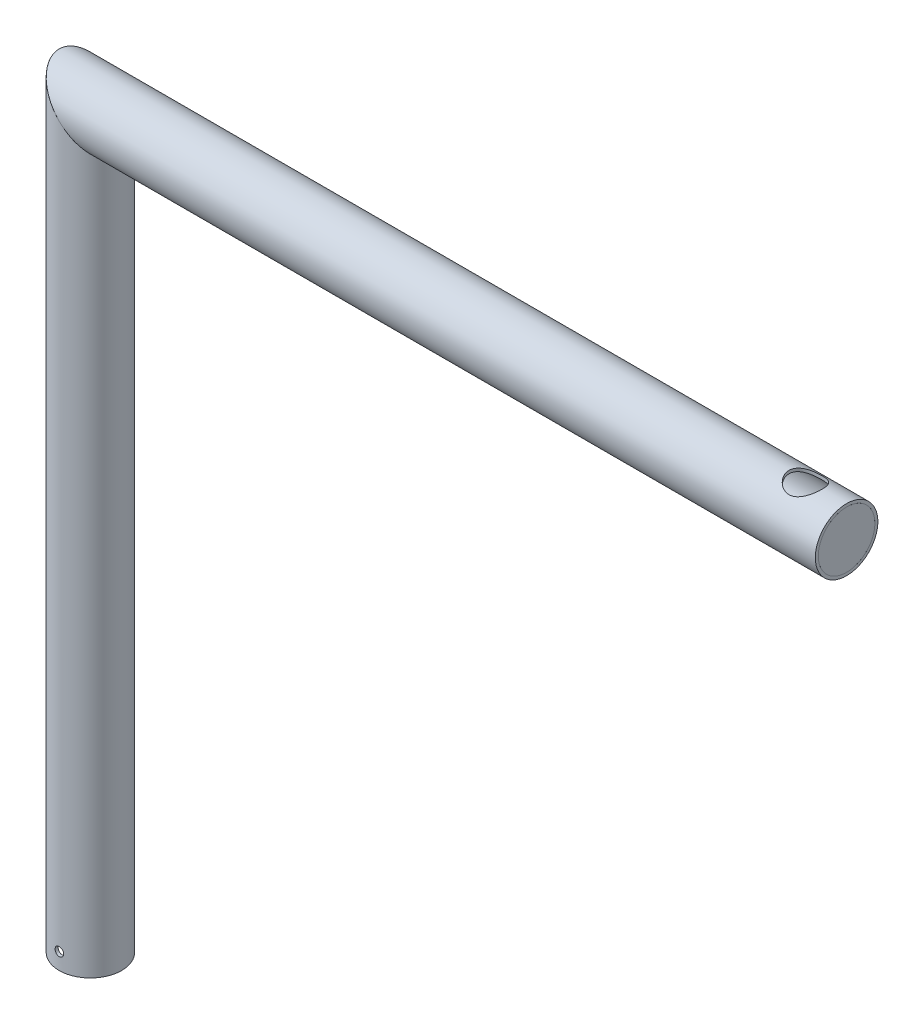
ISO-10303-21;
HEADER;
FILE_DESCRIPTION(('STEP AP214'),'2;1');
FILE_NAME('part.step','',(''),(''),'','','');
FILE_SCHEMA(('AUTOMOTIVE_DESIGN { 1 0 10303 214 1 1 1 1 }'));
ENDSEC;
DATA;
#1=APPLICATION_CONTEXT('core data for automotive mechanical design processes');
#2=APPLICATION_PROTOCOL_DEFINITION('international standard','automotive_design',2000,#1);
#3=PRODUCT_CONTEXT('',#1,'mechanical');
#4=PRODUCT('Part','Part','',(#3));
#5=PRODUCT_RELATED_PRODUCT_CATEGORY('part','',(#4));
#6=PRODUCT_DEFINITION_FORMATION('','',#4);
#7=PRODUCT_DEFINITION_CONTEXT('part definition',#1,'design');
#8=PRODUCT_DEFINITION('design','',#6,#7);
#9=PRODUCT_DEFINITION_SHAPE('','',#8);
#10=(LENGTH_UNIT() NAMED_UNIT(*) SI_UNIT(.MILLI.,.METRE.));
#11=(NAMED_UNIT(*) PLANE_ANGLE_UNIT() SI_UNIT($,.RADIAN.));
#12=(NAMED_UNIT(*) SI_UNIT($,.STERADIAN.) SOLID_ANGLE_UNIT());
#13=UNCERTAINTY_MEASURE_WITH_UNIT(LENGTH_MEASURE(1.E-05),#10,'distance_accuracy_value','');
#14=(GEOMETRIC_REPRESENTATION_CONTEXT(3) GLOBAL_UNCERTAINTY_ASSIGNED_CONTEXT((#13)) GLOBAL_UNIT_ASSIGNED_CONTEXT((#10,
#11,#12)) REPRESENTATION_CONTEXT('',''));
#15=CARTESIAN_POINT('',(0.,0.,0.));
#16=DIRECTION('',(0.,0.,1.));
#17=DIRECTION('',(1.,0.,0.));
#18=AXIS2_PLACEMENT_3D('',#15,#16,#17);
#19=CARTESIAN_POINT('',(915.95,894.95,0.));
#20=DIRECTION('',(1.,0.,0.));
#21=DIRECTION('',(0.,0.,-1.));
#22=AXIS2_PLACEMENT_3D('',#19,#20,#21);
#23=CYLINDRICAL_SURFACE('',#22,34.45);
#24=CARTESIAN_POINT('',(915.95,894.95,0.));
#25=DIRECTION('',(1.,0.,0.));
#26=DIRECTION('',(0.,0.,-1.));
#27=AXIS2_PLACEMENT_3D('',#24,#25,#26);
#28=CIRCLE('',#27,34.45);
#29=CARTESIAN_POINT('',(915.95,894.95,-34.4499999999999));
#30=VERTEX_POINT('',#29);
#31=EDGE_CURVE('E14',#30,#30,#28,.T.);
#32=ORIENTED_EDGE('',*,*,#31,.T.);
#33=EDGE_LOOP('',(#32));
#34=FACE_BOUND('',#33,.T.);
#35=CARTESIAN_POINT('',(919.95,894.95,0.));
#36=DIRECTION('',(1.,0.,0.));
#37=DIRECTION('',(0.,0.,-1.));
#38=AXIS2_PLACEMENT_3D('',#35,#36,#37);
#39=CIRCLE('',#38,34.45);
#40=CARTESIAN_POINT('',(919.95,894.95,-34.45));
#41=VERTEX_POINT('',#40);
#42=EDGE_CURVE('E65',#41,#41,#39,.T.);
#43=ORIENTED_EDGE('',*,*,#42,.F.);
#44=EDGE_LOOP('',(#43));
#45=FACE_BOUND('',#44,.T.);
#46=ADVANCED_FACE('F62',(#34,#45),#23,.T.);
#47=CARTESIAN_POINT('',(915.95,894.95,0.));
#48=DIRECTION('',(1.,0.,0.));
#49=DIRECTION('',(0.,0.,-1.));
#50=AXIS2_PLACEMENT_3D('',#47,#48,#49);
#51=PLANE('',#50);
#52=ORIENTED_EDGE('',*,*,#31,.F.);
#53=EDGE_LOOP('',(#52));
#54=FACE_BOUND('',#53,.T.);
#55=ADVANCED_FACE('F77',(#54),#51,.F.);
#56=CARTESIAN_POINT('',(919.95,894.95,0.));
#57=DIRECTION('',(1.,0.,0.));
#58=DIRECTION('',(0.,0.,-1.));
#59=AXIS2_PLACEMENT_3D('',#56,#57,#58);
#60=PLANE('',#59);
#61=ORIENTED_EDGE('',*,*,#42,.T.);
#62=EDGE_LOOP('',(#61));
#63=FACE_BOUND('',#62,.T.);
#64=ADVANCED_FACE('F74',(#63),#60,.T.);
#65=CLOSED_SHELL('',(#46,#55,#64));
#66=MANIFOLD_SOLID_BREP('B2',#65);
#67=CARTESIAN_POINT('',(0.,894.95,0.));
#68=DIRECTION('',(0.,-1.,0.));
#69=DIRECTION('',(0.,0.,-1.));
#70=AXIS2_PLACEMENT_3D('',#67,#68,#69);
#71=CYLINDRICAL_SURFACE('',#70,34.45);
#72=CARTESIAN_POINT('',(0.,25.2500000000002,-34.45));
#73=CARTESIAN_POINT('',(-0.146587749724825,25.250002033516,-34.4500008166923));
#74=CARTESIAN_POINT('',(-0.293147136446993,25.2438585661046,-34.4490626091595));
#75=CARTESIAN_POINT('',(-0.585260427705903,25.2193340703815,-34.4453377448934));
#76=CARTESIAN_POINT('',(-0.730814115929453,25.2009504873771,-34.4425507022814));
#77=CARTESIAN_POINT('',(-1.01992290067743,25.1520645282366,-34.4352027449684));
#78=CARTESIAN_POINT('',(-1.16347658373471,25.1215539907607,-34.4306406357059));
#79=CARTESIAN_POINT('',(-1.44752213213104,25.0486321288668,-34.4198690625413));
#80=CARTESIAN_POINT('',(-1.58801285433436,25.0062164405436,-34.4136589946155));
#81=CARTESIAN_POINT('',(-1.86472848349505,24.9098602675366,-34.3997741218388));
#82=CARTESIAN_POINT('',(-2.00095807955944,24.8559330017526,-34.3921009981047));
#83=CARTESIAN_POINT('',(-2.26842144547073,24.7368975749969,-34.3754960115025));
#84=CARTESIAN_POINT('',(-2.39965335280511,24.6717852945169,-34.3665636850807));
#85=CARTESIAN_POINT('',(-2.65609784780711,24.5308979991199,-34.3476952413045));
#86=CARTESIAN_POINT('',(-2.78131350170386,24.4551284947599,-34.3377596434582));
#87=CARTESIAN_POINT('',(-3.02498852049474,24.2934060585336,-34.3171517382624));
#88=CARTESIAN_POINT('',(-3.14344535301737,24.2074493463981,-34.3064791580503));
#89=CARTESIAN_POINT('',(-3.37353219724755,24.0253511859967,-34.2846208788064));
#90=CARTESIAN_POINT('',(-3.48511000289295,23.929144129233,-34.2734321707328));
#91=CARTESIAN_POINT('',(-3.69982168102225,23.7276670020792,-34.2509193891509));
#92=CARTESIAN_POINT('',(-3.80295241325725,23.6223935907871,-34.2395952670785));
#93=CARTESIAN_POINT('',(-3.99998085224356,23.4035748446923,-34.2171372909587));
#94=CARTESIAN_POINT('',(-4.09388140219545,23.2900320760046,-34.2060033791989));
#95=CARTESIAN_POINT('',(-4.2718638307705,23.055384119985,-34.184232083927));
#96=CARTESIAN_POINT('',(-4.35594207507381,22.9342761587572,-34.1735948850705));
#97=CARTESIAN_POINT('',(-4.51401955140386,22.6847790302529,-34.1530747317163));
#98=CARTESIAN_POINT('',(-4.58796912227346,22.5563580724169,-34.1431955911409));
#99=CARTESIAN_POINT('',(-4.72480431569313,22.2936162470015,-34.124529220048));
#100=CARTESIAN_POINT('',(-4.7876858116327,22.15929320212,-34.1157423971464));
#101=CARTESIAN_POINT('',(-4.90186266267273,21.885784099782,-34.0995245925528));
#102=CARTESIAN_POINT('',(-4.95316280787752,21.7466000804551,-34.0920930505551));
#103=CARTESIAN_POINT('',(-5.04383865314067,21.4643128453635,-34.0787948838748));
#104=CARTESIAN_POINT('',(-5.08320998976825,21.321208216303,-34.072928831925));
#105=CARTESIAN_POINT('',(-5.18236964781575,20.8898871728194,-34.0580422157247));
#106=CARTESIAN_POINT('',(-5.22421881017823,20.597222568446,-34.0515839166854));
#107=CARTESIAN_POINT('',(-5.25825939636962,20.0091194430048,-34.0463430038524));
#108=CARTESIAN_POINT('',(-5.25045376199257,19.7136810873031,-34.0475599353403));
#109=CARTESIAN_POINT('',(-5.18578103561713,19.130892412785,-34.0574692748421));
#110=CARTESIAN_POINT('',(-5.12933488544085,18.843494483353,-34.0660975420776));
#111=CARTESIAN_POINT('',(-4.9696250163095,18.2823084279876,-34.0897606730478));
#112=CARTESIAN_POINT('',(-4.86635993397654,18.0085206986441,-34.1047957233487));
#113=CARTESIAN_POINT('',(-4.61551179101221,17.4810347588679,-34.1396480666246));
#114=CARTESIAN_POINT('',(-4.4677508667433,17.2274224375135,-34.1594844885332));
#115=CARTESIAN_POINT('',(-4.13223079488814,16.7484331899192,-34.2016910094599));
#116=CARTESIAN_POINT('',(-3.94446893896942,16.5230581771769,-34.2240612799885));
#117=CARTESIAN_POINT('',(-3.53196829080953,16.1045002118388,-34.269098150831));
#118=CARTESIAN_POINT('',(-3.30686758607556,15.9116738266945,-34.2917654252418));
#119=CARTESIAN_POINT('',(-2.82731112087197,15.5664806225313,-34.3346278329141));
#120=CARTESIAN_POINT('',(-2.57285522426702,15.4141139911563,-34.35482295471));
#121=CARTESIAN_POINT('',(-2.04149879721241,15.1541450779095,-34.3904876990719));
#122=CARTESIAN_POINT('',(-1.76458432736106,15.0465708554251,-34.4059543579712));
#123=CARTESIAN_POINT('',(-1.19633192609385,14.8795532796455,-34.4303948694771));
#124=CARTESIAN_POINT('',(-0.904995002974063,14.8201065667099,-34.4393691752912));
#125=CARTESIAN_POINT('',(-0.319244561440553,14.7515068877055,-34.4497536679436));
#126=CARTESIAN_POINT('',(-0.0248897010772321,14.7418638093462,-34.4512375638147));
#127=CARTESIAN_POINT('',(0.561233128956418,14.7718434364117,-34.4466748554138));
#128=CARTESIAN_POINT('',(0.853001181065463,14.8114645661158,-34.440628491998));
#129=CARTESIAN_POINT('',(1.42417958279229,14.9384403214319,-34.4217302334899));
#130=CARTESIAN_POINT('',(1.70364435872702,15.0255556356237,-34.4089124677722));
#131=CARTESIAN_POINT('',(2.24400150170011,15.2447942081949,-34.3779037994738));
#132=CARTESIAN_POINT('',(2.50489297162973,15.3769196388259,-34.359712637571));
#133=CARTESIAN_POINT('',(3.00284930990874,15.6835736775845,-34.3197950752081));
#134=CARTESIAN_POINT('',(3.23972104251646,15.8584125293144,-34.298043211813));
#135=CARTESIAN_POINT('',(3.68093563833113,16.2451002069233,-34.2535031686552));
#136=CARTESIAN_POINT('',(3.88527654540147,16.4569512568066,-34.2307149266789));
#137=CARTESIAN_POINT('',(4.25741731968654,16.9138298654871,-34.1864359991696));
#138=CARTESIAN_POINT('',(4.42488828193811,17.1591267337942,-34.1649581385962));
#139=CARTESIAN_POINT('',(4.71624622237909,17.6746696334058,-34.1259611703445));
#140=CARTESIAN_POINT('',(4.84013440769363,17.9449149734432,-34.1084419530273));
#141=CARTESIAN_POINT('',(5.04030784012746,18.5016554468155,-34.079437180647));
#142=CARTESIAN_POINT('',(5.11676486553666,18.7880877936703,-34.0679298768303));
#143=CARTESIAN_POINT('',(5.22043265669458,19.3700795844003,-34.0522018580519));
#144=CARTESIAN_POINT('',(5.24764694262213,19.6656383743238,-34.0479806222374));
#145=CARTESIAN_POINT('',(5.25094978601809,20.1074170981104,-34.0474652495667));
#146=CARTESIAN_POINT('',(5.24590840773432,20.2537293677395,-34.0482457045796));
#147=CARTESIAN_POINT('',(5.22363854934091,20.5453867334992,-34.0516704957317));
#148=CARTESIAN_POINT('',(5.20641463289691,20.6907321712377,-34.0543141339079));
#149=CARTESIAN_POINT('',(5.15989631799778,20.9794765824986,-34.0613932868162));
#150=CARTESIAN_POINT('',(5.13059757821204,21.1228748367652,-34.0658294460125));
#151=CARTESIAN_POINT('',(5.06016579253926,21.4066195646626,-34.076362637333));
#152=CARTESIAN_POINT('',(5.01903702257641,21.5469671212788,-34.0824590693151));
#153=CARTESIAN_POINT('',(4.92526702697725,21.823613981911,-34.096135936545));
#154=CARTESIAN_POINT('',(4.8726310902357,21.9599151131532,-34.1037156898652));
#155=CARTESIAN_POINT('',(4.75624064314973,22.2275458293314,-34.1201425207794));
#156=CARTESIAN_POINT('',(4.69249013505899,22.3588771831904,-34.128989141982));
#157=CARTESIAN_POINT('',(4.55428664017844,22.6157704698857,-34.1477061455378));
#158=CARTESIAN_POINT('',(4.47982955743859,22.7413301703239,-34.1575769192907));
#159=CARTESIAN_POINT('',(4.32078283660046,22.9857302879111,-34.1780596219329));
#160=CARTESIAN_POINT('',(4.23619679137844,23.1045730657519,-34.1886712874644));
#161=CARTESIAN_POINT('',(4.05653334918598,23.335972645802,-34.2104561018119));
#162=CARTESIAN_POINT('',(3.96135684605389,23.4484520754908,-34.2216339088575));
#163=CARTESIAN_POINT('',(3.76193445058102,23.664969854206,-34.2441295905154));
#164=CARTESIAN_POINT('',(3.65769182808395,23.7690112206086,-34.2554474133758));
#165=CARTESIAN_POINT('',(3.44076148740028,23.968039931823,-34.2779164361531));
#166=CARTESIAN_POINT('',(3.32806874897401,24.0630218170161,-34.289067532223));
#167=CARTESIAN_POINT('',(3.09511241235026,24.2431652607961,-34.3108795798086));
#168=CARTESIAN_POINT('',(2.97485162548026,24.3283304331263,-34.3215407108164));
#169=CARTESIAN_POINT('',(2.72679695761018,24.4887668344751,-34.3421411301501));
#170=CARTESIAN_POINT('',(2.59896171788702,24.563974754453,-34.3520756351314));
#171=CARTESIAN_POINT('',(2.33737454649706,24.7033109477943,-34.3708651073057));
#172=CARTESIAN_POINT('',(2.20362481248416,24.7674432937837,-34.3797204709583));
#173=CARTESIAN_POINT('',(1.93120488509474,24.8841463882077,-34.3960978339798));
#174=CARTESIAN_POINT('',(1.79253835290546,24.9367255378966,-34.4036208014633));
#175=CARTESIAN_POINT('',(1.51123284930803,25.029973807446,-34.4171253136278));
#176=CARTESIAN_POINT('',(1.36859476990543,25.0706455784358,-34.4231072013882));
#177=CARTESIAN_POINT('',(1.02425707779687,25.1532266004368,-34.4353516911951));
#178=CARTESIAN_POINT('',(0.821144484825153,25.1894757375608,-34.4408201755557));
#179=CARTESIAN_POINT('',(0.41200256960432,25.2378608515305,-34.4481437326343));
#180=CARTESIAN_POINT('',(0.205973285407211,25.2499971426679,-34.4499988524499));
#181=CARTESIAN_POINT('',(0.,25.2500000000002,-34.45));
#182=B_SPLINE_CURVE_WITH_KNOTS('',3,(#72,#73,#74,#75,#76,#77,#78,#79,#80,#81,#82,#83,#84,#85,
#86,#87,#88,#89,#90,#91,#92,#93,#94,#95,#96,#97,#98,#99,#100,#101,#102,#103,#104,#105,#106,#107,
#108,#109,#110,#111,#112,#113,#114,#115,#116,#117,#118,#119,#120,#121,#122,#123,#124,#125,#126,
#127,#128,#129,#130,#131,#132,#133,#134,#135,#136,#137,#138,#139,#140,#141,#142,#143,#144,#145,
#146,#147,#148,#149,#150,#151,#152,#153,#154,#155,#156,#157,#158,#159,#160,#161,#162,#163,#164,
#165,#166,#167,#168,#169,#170,#171,#172,#173,#174,#175,#176,#177,#178,#179,#180,#181),
.UNSPECIFIED.,.T.,.F.,(4,2,2,2,2,2,2,2,2,2,2,2,2,2,2,2,2,2,2,2,2,2,2,2,2,2,2,2,2,2,2,2,2,2,2,2,
2,2,2,2,2,2,2,2,2,2,2,2,2,2,2,2,2,2,4),(0.,0.439582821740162,0.879257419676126,1.31922841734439,
1.75936090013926,2.19899066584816,2.63878269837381,3.0783481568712,3.51807724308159,
3.96081243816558,4.40371148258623,4.84647366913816,5.28939916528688,5.73442403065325,
6.17961446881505,6.62462043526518,7.06978898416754,7.95228442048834,8.83472757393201,
9.70960977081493,10.5845174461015,11.4629698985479,12.3414818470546,13.2290682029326,
14.1166586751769,15.0048043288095,15.8928879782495,16.7722152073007,17.651514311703,
18.5264232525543,19.4013744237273,20.2828801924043,21.1644389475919,22.0535689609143,
22.9426743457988,23.8285406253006,24.7143435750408,25.1531196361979,25.5917314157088,
26.0305010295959,26.4691122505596,26.9075223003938,27.3457748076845,27.7841954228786,
28.2224609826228,28.6652416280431,29.1078632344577,29.5507499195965,29.9934730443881,
30.4388881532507,30.8841391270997,31.3290652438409,31.7738922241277,32.3915666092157,
33.0092329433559),.UNSPECIFIED.);
#183=CARTESIAN_POINT('',(0.,25.2500000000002,-34.45));
#184=VERTEX_POINT('',#183);
#185=EDGE_CURVE('E133',#184,#184,#182,.T.);
#186=ORIENTED_EDGE('',*,*,#185,.F.);
#187=EDGE_LOOP('',(#186));
#188=FACE_BOUND('',#187,.T.);
#189=CARTESIAN_POINT('',(5.24999999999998,20.,34.0476137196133));
#190=CARTESIAN_POINT('',(5.25000203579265,19.8534233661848,34.0476128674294));
#191=CARTESIAN_POINT('',(5.2438594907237,19.7068750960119,34.0485621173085));
#192=CARTESIAN_POINT('',(5.21933877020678,19.4147843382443,34.0523298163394));
#193=CARTESIAN_POINT('',(5.20095803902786,19.2692420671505,34.0551486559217));
#194=CARTESIAN_POINT('',(5.15207988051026,18.9801563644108,34.062577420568));
#195=CARTESIAN_POINT('',(5.12157427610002,18.8366143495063,34.0671885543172));
#196=CARTESIAN_POINT('',(5.04866458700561,18.5525923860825,34.0780698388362));
#197=CARTESIAN_POINT('',(5.00625613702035,18.4121135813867,34.084340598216));
#198=CARTESIAN_POINT('',(4.90991744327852,18.1354233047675,34.0983514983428));
#199=CARTESIAN_POINT('',(4.85600056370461,17.9992070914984,34.1060899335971));
#200=CARTESIAN_POINT('',(4.73698842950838,17.7317693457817,34.1228230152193));
#201=CARTESIAN_POINT('',(4.6718890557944,17.6005496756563,34.1318181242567));
#202=CARTESIAN_POINT('',(4.5310295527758,17.3441274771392,34.1508025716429));
#203=CARTESIAN_POINT('',(4.45527492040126,17.2189218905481,34.1607913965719));
#204=CARTESIAN_POINT('',(4.29358360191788,16.9752642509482,34.1814903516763));
#205=CARTESIAN_POINT('',(4.20764313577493,16.8568147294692,34.1922007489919));
#206=CARTESIAN_POINT('',(4.02556125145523,16.6267179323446,34.2141172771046));
#207=CARTESIAN_POINT('',(3.92935243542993,16.5151242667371,34.2253263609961));
#208=CARTESIAN_POINT('',(3.72786843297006,16.3003807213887,34.2478579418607));
#209=CARTESIAN_POINT('',(3.62258990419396,16.1972339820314,34.2591804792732));
#210=CARTESIAN_POINT('',(3.40375774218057,16.0001742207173,34.2816134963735));
#211=CARTESIAN_POINT('',(3.29020669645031,15.9062583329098,34.2927240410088));
#212=CARTESIAN_POINT('',(3.05553904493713,15.7282464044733,34.3144294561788));
#213=CARTESIAN_POINT('',(2.93441966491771,15.6441539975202,34.3250241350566));
#214=CARTESIAN_POINT('',(2.68491341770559,15.4860604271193,34.3454432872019));
#215=CARTESIAN_POINT('',(2.55649562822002,15.4121075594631,34.3552639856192));
#216=CARTESIAN_POINT('',(2.29375986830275,15.2752654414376,34.3738057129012));
#217=CARTESIAN_POINT('',(2.1594397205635,15.2123803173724,34.3825263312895));
#218=CARTESIAN_POINT('',(1.88593651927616,15.0981960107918,34.3986115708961));
#219=CARTESIAN_POINT('',(1.74675549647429,15.046892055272,34.405976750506));
#220=CARTESIAN_POINT('',(1.46447490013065,14.956208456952,34.4191494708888));
#221=CARTESIAN_POINT('',(1.32137391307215,14.9168331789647,34.42495644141));
#222=CARTESIAN_POINT('',(0.890070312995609,14.8176624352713,34.4396883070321));
#223=CARTESIAN_POINT('',(0.597421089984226,14.7758047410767,34.446072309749));
#224=CARTESIAN_POINT('',(0.00934822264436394,14.7417417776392,34.4512558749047));
#225=CARTESIAN_POINT('',(-0.286075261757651,14.7495336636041,34.4500558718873));
#226=CARTESIAN_POINT('',(-0.8689234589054,14.8141842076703,34.4402626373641));
#227=CARTESIAN_POINT('',(-1.15639416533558,14.8706357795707,34.4317307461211));
#228=CARTESIAN_POINT('',(-1.71772295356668,15.0303815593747,34.4082972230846));
#229=CARTESIAN_POINT('',(-1.99158067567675,15.1336770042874,34.3933954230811));
#230=CARTESIAN_POINT('',(-2.5191530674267,15.3845888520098,34.3587920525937));
#231=CARTESIAN_POINT('',(-2.77278519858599,15.5323761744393,34.3390720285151));
#232=CARTESIAN_POINT('',(-3.25180295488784,15.867953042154,34.2970288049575));
#233=CARTESIAN_POINT('',(-3.47718666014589,16.0557453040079,34.2747054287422));
#234=CARTESIAN_POINT('',(-3.8957118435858,16.4682680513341,34.2296767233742));
#235=CARTESIAN_POINT('',(-4.0885028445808,16.6933541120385,34.2069698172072));
#236=CARTESIAN_POINT('',(-4.4336315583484,17.1728684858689,34.1639540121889));
#237=CARTESIAN_POINT('',(-4.58596900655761,17.4272969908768,34.1436451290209));
#238=CARTESIAN_POINT('',(-4.84591669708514,17.9586449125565,34.107725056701));
#239=CARTESIAN_POINT('',(-4.95349006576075,18.2355826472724,34.0921177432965));
#240=CARTESIAN_POINT('',(-5.12049885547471,18.8038857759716,34.0674358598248));
#241=CARTESIAN_POINT('',(-5.17993778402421,19.0952501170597,34.0583608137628));
#242=CARTESIAN_POINT('',(-5.24850800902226,19.6810150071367,34.0478615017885));
#243=CARTESIAN_POINT('',(-5.25813651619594,19.975356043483,34.046361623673));
#244=CARTESIAN_POINT('',(-5.22813268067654,20.5614477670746,34.0509816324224));
#245=CARTESIAN_POINT('',(-5.18850191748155,20.8531985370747,34.0571012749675));
#246=CARTESIAN_POINT('',(-5.06152654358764,21.4242822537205,34.076201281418));
#247=CARTESIAN_POINT('',(-4.97443038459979,21.7036717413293,34.0891459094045));
#248=CARTESIAN_POINT('',(-4.75525522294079,22.2438867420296,34.1204078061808));
#249=CARTESIAN_POINT('',(-4.62317393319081,22.5047113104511,34.1387253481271));
#250=CARTESIAN_POINT('',(-4.31658639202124,23.0026193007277,34.1788469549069));
#251=CARTESIAN_POINT('',(-4.1417587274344,23.2395026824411,34.2006769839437));
#252=CARTESIAN_POINT('',(-3.7550861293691,23.6807459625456,34.2452859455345));
#253=CARTESIAN_POINT('',(-3.54323903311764,23.8851039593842,34.26806493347));
#254=CARTESIAN_POINT('',(-3.08635357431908,24.2572856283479,34.3122420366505));
#255=CARTESIAN_POINT('',(-2.84104507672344,24.4247795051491,34.3336265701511));
#256=CARTESIAN_POINT('',(-2.32547242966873,24.716177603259,34.3723927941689));
#257=CARTESIAN_POINT('',(-2.05520898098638,24.8400830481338,34.3897745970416));
#258=CARTESIAN_POINT('',(-1.49847673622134,25.0402670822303,34.4185193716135));
#259=CARTESIAN_POINT('',(-1.21207344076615,25.1167249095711,34.4299049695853));
#260=CARTESIAN_POINT('',(-0.630143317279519,25.2204041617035,34.4454624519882));
#261=CARTESIAN_POINT('',(-0.334617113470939,25.2476289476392,34.4496348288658));
#262=CARTESIAN_POINT('',(0.107153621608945,25.2509558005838,34.4501475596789));
#263=CARTESIAN_POINT('',(0.253489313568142,25.2459206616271,34.4493773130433));
#264=CARTESIAN_POINT('',(0.545194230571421,25.2236593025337,34.4459933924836));
#265=CARTESIAN_POINT('',(0.690563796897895,25.2064376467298,34.4433804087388));
#266=CARTESIAN_POINT('',(0.979356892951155,25.1599197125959,34.4363797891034));
#267=CARTESIAN_POINT('',(1.12277970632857,25.1306191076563,34.4319915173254));
#268=CARTESIAN_POINT('',(1.40657370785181,25.0601792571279,34.4215659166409));
#269=CARTESIAN_POINT('',(1.54694597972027,25.0190442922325,34.4155291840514));
#270=CARTESIAN_POINT('',(1.82364573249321,24.925256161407,34.4019766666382));
#271=CARTESIAN_POINT('',(1.95997492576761,24.8726079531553,34.3944615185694));
#272=CARTESIAN_POINT('',(2.22765990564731,24.7561881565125,34.3781617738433));
#273=CARTESIAN_POINT('',(2.35901746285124,24.6924205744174,34.3693776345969));
#274=CARTESIAN_POINT('',(2.61596005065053,24.5541787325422,34.3507766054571));
#275=CARTESIAN_POINT('',(2.74154285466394,24.4797003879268,34.3409593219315));
#276=CARTESIAN_POINT('',(2.98598517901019,24.3206077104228,34.3205686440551));
#277=CARTESIAN_POINT('',(3.10484706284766,24.2359969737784,34.3099955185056));
#278=CARTESIAN_POINT('',(3.33624767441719,24.0563067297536,34.2882719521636));
#279=CARTESIAN_POINT('',(3.44871111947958,23.961130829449,34.2771167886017));
#280=CARTESIAN_POINT('',(3.66519666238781,23.7617129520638,34.2546445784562));
#281=CARTESIAN_POINT('',(3.76922177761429,23.6574742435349,34.2433275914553));
#282=CARTESIAN_POINT('',(3.96821845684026,23.4405549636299,34.2208383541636));
#283=CARTESIAN_POINT('',(4.06318454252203,23.3278693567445,34.2096661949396));
#284=CARTESIAN_POINT('',(4.24329741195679,23.0949304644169,34.1877925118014));
#285=CARTESIAN_POINT('',(4.32844780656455,22.9746799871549,34.1770908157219));
#286=CARTESIAN_POINT('',(4.48886613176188,22.7266335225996,34.1563927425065));
#287=CARTESIAN_POINT('',(4.56406948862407,22.5987953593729,34.1464011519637));
#288=CARTESIAN_POINT('',(4.70339628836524,22.3372028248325,34.1274890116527));
#289=CARTESIAN_POINT('',(4.7675238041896,22.203450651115,34.1185680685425));
#290=CARTESIAN_POINT('',(4.88421712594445,21.931025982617,34.1020585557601));
#291=CARTESIAN_POINT('',(4.93679135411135,21.7923571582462,34.0944690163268));
#292=CARTESIAN_POINT('',(5.03002979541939,21.5110465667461,34.0808379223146));
#293=CARTESIAN_POINT('',(5.07069666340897,21.3684056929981,34.0747960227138));
#294=CARTESIAN_POINT('',(5.15325711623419,21.024096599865,34.0624256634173));
#295=CARTESIAN_POINT('',(5.1894947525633,20.8210161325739,34.0568970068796));
#296=CARTESIAN_POINT('',(5.23786460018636,20.4119384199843,34.0494916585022));
#297=CARTESIAN_POINT('',(5.24999713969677,20.2059412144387,34.0476149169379));
#298=CARTESIAN_POINT('',(5.24999999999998,20.,34.0476137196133));
#299=B_SPLINE_CURVE_WITH_KNOTS('',3,(#189,#190,#191,#192,#193,#194,#195,#196,#197,#198,#199,
#200,#201,#202,#203,#204,#205,#206,#207,#208,#209,#210,#211,#212,#213,#214,#215,#216,#217,#218,
#219,#220,#221,#222,#223,#224,#225,#226,#227,#228,#229,#230,#231,#232,#233,#234,#235,#236,#237,
#238,#239,#240,#241,#242,#243,#244,#245,#246,#247,#248,#249,#250,#251,#252,#253,#254,#255,#256,
#257,#258,#259,#260,#261,#262,#263,#264,#265,#266,#267,#268,#269,#270,#271,#272,#273,#274,#275,
#276,#277,#278,#279,#280,#281,#282,#283,#284,#285,#286,#287,#288,#289,#290,#291,#292,#293,#294,
#295,#296,#297,#298),.UNSPECIFIED.,.T.,.F.,(4,2,2,2,2,2,2,2,2,2,2,2,2,2,2,2,2,2,2,2,2,2,2,2,2,2,
2,2,2,2,2,2,2,2,2,2,2,2,2,2,2,2,2,2,2,2,2,2,2,2,2,2,2,2,4),(0.,0.43954943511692,
0.879190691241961,1.31912894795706,1.75922876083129,2.19882026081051,2.63857403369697,
3.07810176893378,3.51779312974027,3.96057221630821,4.40351517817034,4.84632018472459,
5.28928846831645,5.73429834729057,6.17947378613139,6.62446541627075,7.06961967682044,
7.95207080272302,8.83447136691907,9.70956064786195,10.5846730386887,11.4631911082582,
12.3417688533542,13.2292641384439,14.1167652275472,15.0049959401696,15.8931619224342,
16.7724448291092,17.6516995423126,18.5263955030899,19.4011359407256,20.2826675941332,
21.1642507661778,22.0534262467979,22.9425767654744,23.8283476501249,24.7140580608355,
25.1529035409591,25.5915847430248,26.0304232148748,26.4691031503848,26.9075945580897,
27.3459283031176,27.7844296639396,28.2227758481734,28.6655138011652,29.1080927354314,
29.5509376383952,29.9936191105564,30.4390463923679,30.8843095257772,31.3292469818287,
31.774085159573,32.3916636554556,33.0092337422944),.UNSPECIFIED.);
#300=CARTESIAN_POINT('',(5.24999999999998,20.,34.0476137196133));
#301=VERTEX_POINT('',#300);
#302=EDGE_CURVE('E153',#301,#301,#299,.T.);
#303=ORIENTED_EDGE('',*,*,#302,.F.);
#304=EDGE_LOOP('',(#303));
#305=FACE_BOUND('',#304,.T.);
#306=CARTESIAN_POINT('',(0.,0.,0.));
#307=DIRECTION('',(0.,1.,0.));
#308=DIRECTION('',(0.,0.,1.));
#309=AXIS2_PLACEMENT_3D('',#306,#307,#308);
#310=CIRCLE('',#309,34.45);
#311=CARTESIAN_POINT('',(0.,0.,34.45));
#312=VERTEX_POINT('',#311);
#313=EDGE_CURVE('E122',#312,#312,#310,.T.);
#314=ORIENTED_EDGE('',*,*,#313,.F.);
#315=EDGE_LOOP('',(#314));
#316=FACE_BOUND('',#315,.T.);
#317=CARTESIAN_POINT('',(0.,894.95,0.));
#318=DIRECTION('',(0.707106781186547,0.707106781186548,0.));
#319=DIRECTION('',(0.707106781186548,-0.707106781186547,0.));
#320=AXIS2_PLACEMENT_3D('',#317,#318,#319);
#321=ELLIPSE('',#320,48.7196572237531,34.45);
#322=CARTESIAN_POINT('',(34.45,860.5,0.));
#323=VERTEX_POINT('',#322);
#324=EDGE_CURVE('E131',#323,#323,#321,.T.);
#325=ORIENTED_EDGE('',*,*,#324,.T.);
#326=EDGE_LOOP('',(#325));
#327=FACE_BOUND('',#326,.T.);
#328=ADVANCED_FACE('F111',(#188,#305,#316,#327),#71,.F.);
#329=CARTESIAN_POINT('',(0.,894.95,0.));
#330=DIRECTION('',(0.,-1.,0.));
#331=DIRECTION('',(0.,0.,-1.));
#332=AXIS2_PLACEMENT_3D('',#329,#330,#331);
#333=CYLINDRICAL_SURFACE('',#332,38.05);
#334=CARTESIAN_POINT('',(0.,25.2500000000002,-38.05));
#335=CARTESIAN_POINT('',(-0.146751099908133,25.2500018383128,-38.0500006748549));
#336=CARTESIAN_POINT('',(-0.293475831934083,25.2438447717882,-38.0491493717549));
#337=CARTESIAN_POINT('',(-0.585920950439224,25.2192647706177,-38.0457693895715));
#338=CARTESIAN_POINT('',(-0.731641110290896,25.2008391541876,-38.0432403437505));
#339=CARTESIAN_POINT('',(-1.02108962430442,25.1518385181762,-38.0365725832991));
#340=CARTESIAN_POINT('',(-1.16481648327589,25.1212548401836,-38.0324327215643));
#341=CARTESIAN_POINT('',(-1.44920744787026,25.0481541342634,-38.0226583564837));
#342=CARTESIAN_POINT('',(-1.58987041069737,25.0056327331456,-38.0170233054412));
#343=CARTESIAN_POINT('',(-1.86693359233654,24.9090284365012,-38.0044243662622));
#344=CARTESIAN_POINT('',(-2.00333829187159,24.8549581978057,-37.9974619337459));
#345=CARTESIAN_POINT('',(-2.2711426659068,24.7356003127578,-37.982396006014));
#346=CARTESIAN_POINT('',(-2.4025404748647,24.6703085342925,-37.9742920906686));
#347=CARTESIAN_POINT('',(-2.65929880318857,24.5290274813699,-37.9571755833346));
#348=CARTESIAN_POINT('',(-2.78466250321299,24.4530439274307,-37.9481634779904));
#349=CARTESIAN_POINT('',(-3.02861104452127,24.2908597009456,-37.9294738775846));
#350=CARTESIAN_POINT('',(-3.1471933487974,24.2046552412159,-37.9197961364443));
#351=CARTESIAN_POINT('',(-3.37735741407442,24.0221447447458,-37.8999917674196));
#352=CARTESIAN_POINT('',(-3.48889642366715,23.9257850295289,-37.8898629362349));
#353=CARTESIAN_POINT('',(-3.7035149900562,23.7240004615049,-37.8694877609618));
#354=CARTESIAN_POINT('',(-3.80659140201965,23.6185722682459,-37.8592413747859));
#355=CARTESIAN_POINT('',(-4.00349179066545,23.3994474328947,-37.8389263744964));
#356=CARTESIAN_POINT('',(-4.09731865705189,23.2857533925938,-37.8288577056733));
#357=CARTESIAN_POINT('',(-4.27513287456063,23.0508115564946,-37.8091754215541));
#358=CARTESIAN_POINT('',(-4.35911658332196,22.9295609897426,-37.799561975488));
#359=CARTESIAN_POINT('',(-4.51690771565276,22.6799125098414,-37.7810320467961));
#360=CARTESIAN_POINT('',(-4.59067548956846,22.5514893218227,-37.7721183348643));
#361=CARTESIAN_POINT('',(-4.72714926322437,22.288773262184,-37.7552816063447));
#362=CARTESIAN_POINT('',(-4.7898511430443,22.1544782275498,-37.7473589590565));
#363=CARTESIAN_POINT('',(-4.90367607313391,21.8810552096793,-37.7327412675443));
#364=CARTESIAN_POINT('',(-4.95480381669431,21.7419292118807,-37.7260457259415));
#365=CARTESIAN_POINT('',(-5.04514668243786,21.4597875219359,-37.7140695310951));
#366=CARTESIAN_POINT('',(-5.08435743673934,21.3167704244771,-37.7087893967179));
#367=CARTESIAN_POINT('',(-5.18315425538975,20.8853543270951,-37.6953851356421));
#368=CARTESIAN_POINT('',(-5.22475944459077,20.5925304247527,-37.6895835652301));
#369=CARTESIAN_POINT('',(-5.25827235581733,20.0041640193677,-37.6849217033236));
#370=CARTESIAN_POINT('',(-5.25018249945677,19.7086216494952,-37.6860610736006));
#371=CARTESIAN_POINT('',(-5.18485509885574,19.125190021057,-37.6951036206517));
#372=CARTESIAN_POINT('',(-5.12796126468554,18.8372617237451,-37.7029594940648));
#373=CARTESIAN_POINT('',(-4.96716055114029,18.2750894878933,-37.7244792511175));
#374=CARTESIAN_POINT('',(-4.86325253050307,18.0008458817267,-37.7381432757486));
#375=CARTESIAN_POINT('',(-4.6110141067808,17.4727568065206,-37.7697918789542));
#376=CARTESIAN_POINT('',(-4.46253618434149,17.2189826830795,-37.7877907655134));
#377=CARTESIAN_POINT('',(-4.1254767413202,16.7398225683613,-37.826070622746));
#378=CARTESIAN_POINT('',(-3.93689298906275,16.514438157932,-37.8463517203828));
#379=CARTESIAN_POINT('',(-3.52307905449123,16.0964601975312,-37.8871205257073));
#380=CARTESIAN_POINT('',(-3.29755289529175,15.9041595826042,-37.9076085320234));
#381=CARTESIAN_POINT('',(-2.81726985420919,15.5600954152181,-37.9463230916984));
#382=CARTESIAN_POINT('',(-2.56251287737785,15.4083319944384,-37.964549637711));
#383=CARTESIAN_POINT('',(-2.03076002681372,15.1496425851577,-37.9967026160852));
#384=CARTESIAN_POINT('',(-1.75375407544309,15.0427370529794,-38.0106270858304));
#385=CARTESIAN_POINT('',(-1.18548691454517,14.8770416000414,-38.0325899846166));
#386=CARTESIAN_POINT('',(-0.894226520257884,14.8182489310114,-38.0406287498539));
#387=CARTESIAN_POINT('',(-0.308248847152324,14.7508326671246,-38.0498703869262));
#388=CARTESIAN_POINT('',(-0.0135787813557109,14.7418059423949,-38.0511281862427));
#389=CARTESIAN_POINT('',(0.573070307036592,14.7731108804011,-38.0468150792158));
#390=CARTESIAN_POINT('',(0.865049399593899,14.8134412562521,-38.0412443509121));
#391=CARTESIAN_POINT('',(1.43682312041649,14.9419804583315,-38.0239341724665));
#392=CARTESIAN_POINT('',(1.71666225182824,15.029994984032,-38.0122197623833));
#393=CARTESIAN_POINT('',(2.25761037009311,15.2512007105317,-37.9839324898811));
#394=CARTESIAN_POINT('',(2.51871859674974,15.384393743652,-37.9673594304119));
#395=CARTESIAN_POINT('',(3.01657969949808,15.6931359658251,-37.9310626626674));
#396=CARTESIAN_POINT('',(3.25317100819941,15.8689434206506,-37.9113200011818));
#397=CARTESIAN_POINT('',(3.69363341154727,16.2575625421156,-37.8709464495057));
#398=CARTESIAN_POINT('',(3.89750290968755,16.4703760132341,-37.8503155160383));
#399=CARTESIAN_POINT('',(4.26818350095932,16.9287475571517,-37.8103186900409));
#400=CARTESIAN_POINT('',(4.43472584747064,17.1745239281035,-37.7909626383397));
#401=CARTESIAN_POINT('',(4.72416093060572,17.6908102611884,-37.7558757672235));
#402=CARTESIAN_POINT('',(4.84705469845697,17.9613196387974,-37.7401448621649));
#403=CARTESIAN_POINT('',(5.04528344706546,18.5185033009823,-37.7141568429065));
#404=CARTESIAN_POINT('',(5.12076490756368,18.8051247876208,-37.7038828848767));
#405=CARTESIAN_POINT('',(5.22247604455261,19.3872893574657,-37.689932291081));
#406=CARTESIAN_POINT('',(5.24870855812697,19.6828319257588,-37.6862552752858));
#407=CARTESIAN_POINT('',(5.2505730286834,20.1247455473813,-37.6859900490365));
#408=CARTESIAN_POINT('',(5.24503702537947,20.2712705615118,-37.6867641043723));
#409=CARTESIAN_POINT('',(5.22174240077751,20.5633122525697,-37.6899997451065));
#410=CARTESIAN_POINT('',(5.20398834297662,20.7088292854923,-37.6924607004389));
#411=CARTESIAN_POINT('',(5.15637644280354,20.9978755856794,-37.6990032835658));
#412=CARTESIAN_POINT('',(5.12651421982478,21.1414041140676,-37.7030854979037));
#413=CARTESIAN_POINT('',(5.05492436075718,21.4253659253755,-37.7127504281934));
#414=CARTESIAN_POINT('',(5.01320102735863,21.5658003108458,-37.7183325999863));
#415=CARTESIAN_POINT('',(4.91819974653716,21.8426126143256,-37.7308375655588));
#416=CARTESIAN_POINT('',(4.86492394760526,21.9789912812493,-37.7377601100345));
#417=CARTESIAN_POINT('',(4.74722114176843,22.2467236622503,-37.7527470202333));
#418=CARTESIAN_POINT('',(4.68279816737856,22.3780791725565,-37.7608109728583));
#419=CARTESIAN_POINT('',(4.54322129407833,22.6349603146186,-37.7778583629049));
#420=CARTESIAN_POINT('',(4.46806338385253,22.7604837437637,-37.7868421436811));
#421=CARTESIAN_POINT('',(4.30759262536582,23.0047449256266,-37.8054713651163));
#422=CARTESIAN_POINT('',(4.22228340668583,23.1234850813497,-37.8151165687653));
#423=CARTESIAN_POINT('',(4.04131266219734,23.3543989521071,-37.8348866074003));
#424=CARTESIAN_POINT('',(3.94556920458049,23.4665081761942,-37.8450148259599));
#425=CARTESIAN_POINT('',(3.74503906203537,23.6822360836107,-37.8653843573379));
#426=CARTESIAN_POINT('',(3.64025565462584,23.7858578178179,-37.8756256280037));
#427=CARTESIAN_POINT('',(3.42227662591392,23.9839966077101,-37.8959431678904));
#428=CARTESIAN_POINT('',(3.30907598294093,24.0785081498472,-37.9060193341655));
#429=CARTESIAN_POINT('',(3.07514576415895,24.2576607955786,-37.9257135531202));
#430=CARTESIAN_POINT('',(2.95441898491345,24.3423055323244,-37.9353317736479));
#431=CARTESIAN_POINT('',(2.70561210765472,24.5015651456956,-37.9538904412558));
#432=CARTESIAN_POINT('',(2.57749817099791,24.5761275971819,-37.9628272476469));
#433=CARTESIAN_POINT('',(2.3154233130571,24.7141533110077,-37.979712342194));
#434=CARTESIAN_POINT('',(2.18146456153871,24.7776206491,-37.9876609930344));
#435=CARTESIAN_POINT('',(1.90870370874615,24.8929803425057,-38.002341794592));
#436=CARTESIAN_POINT('',(1.7699053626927,24.9448814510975,-38.0090748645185));
#437=CARTESIAN_POINT('',(1.48840952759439,25.0367709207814,-38.0211387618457));
#438=CARTESIAN_POINT('',(1.34571294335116,25.0767620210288,-38.0264699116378));
#439=CARTESIAN_POINT('',(1.00493942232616,25.1568746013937,-38.0372346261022));
#440=CARTESIAN_POINT('',(0.805586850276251,25.1917591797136,-38.0420009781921));
#441=CARTESIAN_POINT('',(0.404139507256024,25.2383205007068,-38.048383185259));
#442=CARTESIAN_POINT('',(0.202044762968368,25.2499974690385,-38.0499990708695));
#443=CARTESIAN_POINT('',(0.,25.2500000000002,-38.05));
#444=B_SPLINE_CURVE_WITH_KNOTS('',3,(#334,#335,#336,#337,#338,#339,#340,#341,#342,#343,#344,
#345,#346,#347,#348,#349,#350,#351,#352,#353,#354,#355,#356,#357,#358,#359,#360,#361,#362,#363,
#364,#365,#366,#367,#368,#369,#370,#371,#372,#373,#374,#375,#376,#377,#378,#379,#380,#381,#382,
#383,#384,#385,#386,#387,#388,#389,#390,#391,#392,#393,#394,#395,#396,#397,#398,#399,#400,#401,
#402,#403,#404,#405,#406,#407,#408,#409,#410,#411,#412,#413,#414,#415,#416,#417,#418,#419,#420,
#421,#422,#423,#424,#425,#426,#427,#428,#429,#430,#431,#432,#433,#434,#435,#436,#437,#438,#439,
#440,#441,#442,#443),.UNSPECIFIED.,.T.,.F.,(4,2,2,2,2,2,2,2,2,2,2,2,2,2,2,2,2,2,2,2,2,2,2,2,2,2,
2,2,2,2,2,2,2,2,2,2,2,2,2,2,2,2,2,2,2,2,2,2,2,2,2,2,2,2,4),(0.,0.440076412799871,
0.880249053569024,1.32073572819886,1.76138397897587,2.20155176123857,2.64188197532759,
3.08197748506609,3.5222365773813,3.96495211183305,4.40783142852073,4.85057194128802,
5.2934757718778,5.73805309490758,6.18279559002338,6.62735741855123,7.07208199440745,
7.95491737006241,8.8377097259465,9.71433544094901,10.5909824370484,11.470563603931,
12.3501937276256,13.2372509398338,14.1243110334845,15.0117752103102,15.8991886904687,
16.7794029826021,17.6595943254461,18.5362257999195,19.4128928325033,20.2950119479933,
21.1771740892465,22.06549695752,22.9537988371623,23.8393426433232,24.7248354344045,
25.1643023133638,25.6036051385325,26.0430670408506,26.4823697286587,26.9215907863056,
27.3606532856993,27.7998802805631,28.2389506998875,28.6817581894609,29.1244058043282,
29.5673196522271,30.0100698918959,30.455040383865,30.8998470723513,31.3443159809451,
31.7886825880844,32.3945792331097,33.0004699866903),.UNSPECIFIED.);
#445=CARTESIAN_POINT('',(0.,25.2500000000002,-38.05));
#446=VERTEX_POINT('',#445);
#447=EDGE_CURVE('E115',#446,#446,#444,.T.);
#448=ORIENTED_EDGE('',*,*,#447,.T.);
#449=EDGE_LOOP('',(#448));
#450=FACE_BOUND('',#449,.T.);
#451=CARTESIAN_POINT('',(5.24999999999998,20.,37.6860716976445));
#452=CARTESIAN_POINT('',(5.25000183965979,19.85325637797,37.6860709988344));
#453=CARTESIAN_POINT('',(5.2438453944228,19.7065391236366,37.6869305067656));
#454=CARTESIAN_POINT('',(5.21926793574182,19.414109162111,37.6903423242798));
#455=CARTESIAN_POINT('',(5.20084423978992,19.2683966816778,37.692895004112));
#456=CARTESIAN_POINT('',(5.15184885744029,18.9789636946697,37.6996228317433));
#457=CARTESIAN_POINT('',(5.12126850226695,18.8352446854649,37.7037991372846));
#458=CARTESIAN_POINT('',(5.04817599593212,18.5508695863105,37.7136550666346));
#459=CARTESIAN_POINT('',(5.00565947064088,18.410214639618,37.7193352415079));
#460=CARTESIAN_POINT('',(4.90906694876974,18.1331685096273,37.7320279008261));
#461=CARTESIAN_POINT('',(4.85500370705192,17.9967728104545,37.7390389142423));
#462=CARTESIAN_POINT('',(4.73566151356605,17.7289856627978,37.7542001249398));
#463=CARTESIAN_POINT('',(4.67037842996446,17.5975960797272,37.7623507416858));
#464=CARTESIAN_POINT('',(4.52911609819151,17.340852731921,37.7795535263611));
#465=CARTESIAN_POINT('',(4.45314256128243,17.2154957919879,37.7886052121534));
#466=CARTESIAN_POINT('',(4.29097929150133,16.9715589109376,37.8073624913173));
#467=CARTESIAN_POINT('',(4.20478577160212,16.852981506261,37.8170683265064));
#468=CARTESIAN_POINT('',(4.02228621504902,16.6228107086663,37.8369156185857));
#469=CARTESIAN_POINT('',(3.92592529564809,16.51126101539,37.8470592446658));
#470=CARTESIAN_POINT('',(3.72413605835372,16.296620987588,37.8674476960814));
#471=CARTESIAN_POINT('',(3.61870439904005,16.1935337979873,37.8776925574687));
#472=CARTESIAN_POINT('',(3.39957049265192,15.996612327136,37.8979883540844));
#473=CARTESIAN_POINT('',(3.285870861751,15.9027751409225,37.9080393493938));
#474=CARTESIAN_POINT('',(3.05091573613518,15.7249410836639,37.9276721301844));
#475=CARTESIAN_POINT('',(2.92965747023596,15.6409478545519,37.937253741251));
#476=CARTESIAN_POINT('',(2.68000288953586,15.4831459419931,37.955708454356));
#477=CARTESIAN_POINT('',(2.55158188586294,15.409375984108,37.964578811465));
#478=CARTESIAN_POINT('',(2.28887002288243,15.2728976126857,37.9813231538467));
#479=CARTESIAN_POINT('',(2.15457700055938,15.2101933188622,37.9891967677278));
#480=CARTESIAN_POINT('',(1.88115808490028,15.0963634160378,38.0037163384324));
#481=CARTESIAN_POINT('',(1.74203417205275,15.0452331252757,38.0103627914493));
#482=CARTESIAN_POINT('',(1.45989708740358,14.9548850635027,38.0222462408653));
#483=CARTESIAN_POINT('',(1.31688251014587,14.9156716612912,38.0274827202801));
#484=CARTESIAN_POINT('',(0.885478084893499,14.8168673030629,38.0407726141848));
#485=CARTESIAN_POINT('',(0.592664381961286,14.7752563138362,38.0465193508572));
#486=CARTESIAN_POINT('',(0.00431800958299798,14.741728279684,38.0511390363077));
#487=CARTESIAN_POINT('',(-0.291214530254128,14.7498088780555,38.0500123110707));
#488=CARTESIAN_POINT('',(-0.87468647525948,14.8151214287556,38.0410560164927));
#489=CARTESIAN_POINT('',(-1.16266383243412,14.8720189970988,38.0332720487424));
#490=CARTESIAN_POINT('',(-1.72493224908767,15.0328441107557,38.0119236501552));
#491=CARTESIAN_POINT('',(-1.99922300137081,15.1367727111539,37.998359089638));
#492=CARTESIAN_POINT('',(-2.52736997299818,15.3890541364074,37.9668958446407));
#493=CARTESIAN_POINT('',(-2.78115713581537,15.5375497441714,37.9489832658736));
#494=CARTESIAN_POINT('',(-3.2603358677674,15.874647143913,37.9108240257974));
#495=CARTESIAN_POINT('',(-3.48572585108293,16.0632511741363,37.8905772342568));
#496=CARTESIAN_POINT('',(-3.90368162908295,16.4770797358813,37.8498126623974));
#497=CARTESIAN_POINT('',(-4.09595856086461,16.7025960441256,37.8292940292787));
#498=CARTESIAN_POINT('',(-4.43997960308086,17.1828508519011,37.7904637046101));
#499=CARTESIAN_POINT('',(-4.59172353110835,17.4375894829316,37.7721520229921));
#500=CARTESIAN_POINT('',(-4.8503988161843,17.9693368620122,37.7398094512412));
#501=CARTESIAN_POINT('',(-4.95730378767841,18.2463586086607,37.7257810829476));
#502=CARTESIAN_POINT('',(-5.12299330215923,18.8146601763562,37.7036403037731));
#503=CARTESIAN_POINT('',(-5.18178069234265,19.1059391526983,37.695527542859));
#504=CARTESIAN_POINT('',(-5.24917699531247,19.6919262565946,37.6862018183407));
#505=CARTESIAN_POINT('',(-5.25819389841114,19.9865865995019,37.6849327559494));
#506=CARTESIAN_POINT('',(-5.22687278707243,20.5732139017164,37.6892894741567));
#507=CARTESIAN_POINT('',(-5.18653606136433,20.8651809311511,37.6949150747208));
#508=CARTESIAN_POINT('',(-5.05799750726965,21.4368906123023,37.7123759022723));
#509=CARTESIAN_POINT('',(-4.9699960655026,21.7166791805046,37.7241851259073));
#510=CARTESIAN_POINT('',(-4.74883338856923,22.2575319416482,37.7526613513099));
#511=CARTESIAN_POINT('',(-4.61567024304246,22.5185953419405,37.7693285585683));
#512=CARTESIAN_POINT('',(-4.30697272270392,23.0164246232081,37.8057760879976));
#513=CARTESIAN_POINT('',(-4.13117250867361,23.2530242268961,37.8255756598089));
#514=CARTESIAN_POINT('',(-3.74256280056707,23.693506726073,37.865997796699));
#515=CARTESIAN_POINT('',(-3.52975154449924,23.8973880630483,37.886620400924));
#516=CARTESIAN_POINT('',(-3.07137510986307,24.2680960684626,37.9265389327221));
#517=CARTESIAN_POINT('',(-2.82559118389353,24.4346535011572,37.9458245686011));
#518=CARTESIAN_POINT('',(-2.30928554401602,24.7241150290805,37.9807389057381));
#519=CARTESIAN_POINT('',(-2.03876441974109,24.8470201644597,37.9963676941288));
#520=CARTESIAN_POINT('',(-1.48158668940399,25.0452560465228,38.022163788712));
#521=CARTESIAN_POINT('',(-1.19498464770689,25.1207381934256,38.0323484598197));
#522=CARTESIAN_POINT('',(-0.612861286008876,25.2224573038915,38.0461747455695));
#523=CARTESIAN_POINT('',(-0.317340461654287,25.2486969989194,38.0498167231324));
#524=CARTESIAN_POINT('',(0.124568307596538,25.2505776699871,38.0500814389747));
#525=CARTESIAN_POINT('',(0.27110938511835,25.2450458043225,38.0493154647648));
#526=CARTESIAN_POINT('',(0.563183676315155,25.2217567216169,38.0461111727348));
#527=CARTESIAN_POINT('',(0.708717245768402,25.2040040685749,38.0436734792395));
#528=CARTESIAN_POINT('',(0.997796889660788,25.1563921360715,38.0371901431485));
#529=CARTESIAN_POINT('',(1.1413422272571,25.1265284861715,38.0331439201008));
#530=CARTESIAN_POINT('',(1.42533773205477,25.0549328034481,38.0235596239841));
#531=CARTESIAN_POINT('',(1.56578900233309,25.0132050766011,38.0180220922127));
#532=CARTESIAN_POINT('',(1.84263684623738,24.9181912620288,38.0056099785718));
#533=CARTESIAN_POINT('',(1.9790341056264,24.8649071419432,37.9987356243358));
#534=CARTESIAN_POINT('',(2.24680240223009,24.747184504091,37.9838433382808));
#535=CARTESIAN_POINT('',(2.37817523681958,24.6827500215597,37.9758258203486));
#536=CARTESIAN_POINT('',(2.63508892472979,24.5431473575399,37.9588644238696));
#537=CARTESIAN_POINT('',(2.76062757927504,24.4679751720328,37.9499202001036));
#538=CARTESIAN_POINT('',(3.00491651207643,24.3074736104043,37.9313587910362));
#539=CARTESIAN_POINT('',(3.12366919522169,24.2221478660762,37.9217418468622));
#540=CARTESIAN_POINT('',(3.35458329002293,24.0411593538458,37.9020159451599));
#541=CARTESIAN_POINT('',(3.4666816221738,23.9454164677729,37.8919035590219));
#542=CARTESIAN_POINT('',(3.68238759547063,23.7448897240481,37.8715494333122));
#543=CARTESIAN_POINT('',(3.78599828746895,23.6401091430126,37.8613077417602));
#544=CARTESIAN_POINT('',(3.98411535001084,23.4221379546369,37.8409731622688));
#545=CARTESIAN_POINT('',(4.07861619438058,23.3089423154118,37.8308803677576));
#546=CARTESIAN_POINT('',(4.25774818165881,23.0750242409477,37.8111385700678));
#547=CARTESIAN_POINT('',(4.34238295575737,22.9543046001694,37.8014894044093));
#548=CARTESIAN_POINT('',(4.50163060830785,22.7055032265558,37.7828570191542));
#549=CARTESIAN_POINT('',(4.57619017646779,22.5773870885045,37.7738774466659));
#550=CARTESIAN_POINT('',(4.71420990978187,22.3153081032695,37.7569008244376));
#551=CARTESIAN_POINT('',(4.77767415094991,22.181347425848,37.7489034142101));
#552=CARTESIAN_POINT('',(4.89302752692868,21.9085827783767,37.7341246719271));
#553=CARTESIAN_POINT('',(4.944925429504,21.7697825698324,37.7273424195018));
#554=CARTESIAN_POINT('',(5.03680843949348,21.4882826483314,37.7151853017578));
#555=CARTESIAN_POINT('',(5.07679628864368,21.3455838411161,37.7098101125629));
#556=CARTESIAN_POINT('',(5.15689508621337,21.0048295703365,37.6989542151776));
#557=CARTESIAN_POINT('',(5.19177194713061,20.8054989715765,37.6941447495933));
#558=CARTESIAN_POINT('',(5.23832302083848,20.4040955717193,37.6877039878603));
#559=CARTESIAN_POINT('',(5.24999746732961,20.2020227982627,37.6860726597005));
#560=CARTESIAN_POINT('',(5.24999999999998,20.,37.6860716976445));
#561=B_SPLINE_CURVE_WITH_KNOTS('',3,(#451,#452,#453,#454,#455,#456,#457,#458,#459,#460,#461,
#462,#463,#464,#465,#466,#467,#468,#469,#470,#471,#472,#473,#474,#475,#476,#477,#478,#479,#480,
#481,#482,#483,#484,#485,#486,#487,#488,#489,#490,#491,#492,#493,#494,#495,#496,#497,#498,#499,
#500,#501,#502,#503,#504,#505,#506,#507,#508,#509,#510,#511,#512,#513,#514,#515,#516,#517,#518,
#519,#520,#521,#522,#523,#524,#525,#526,#527,#528,#529,#530,#531,#532,#533,#534,#535,#536,#537,
#538,#539,#540,#541,#542,#543,#544,#545,#546,#547,#548,#549,#550,#551,#552,#553,#554,#555,#556,
#557,#558,#559,#560),.UNSPECIFIED.,.T.,.F.,(4,2,2,2,2,2,2,2,2,2,2,2,2,2,2,2,2,2,2,2,2,2,2,2,2,2,
2,2,2,2,2,2,2,2,2,2,2,2,2,2,2,2,2,2,2,2,2,2,2,2,2,2,2,2,4),(0.,0.440053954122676,
0.880204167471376,1.32066881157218,1.76129507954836,2.20143711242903,2.6417415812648,
3.08181170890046,3.52204541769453,3.96479047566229,4.40769933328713,4.85046864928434,
5.29340126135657,5.7379683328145,6.18270056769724,6.62725258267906,7.07196737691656,
7.95477342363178,8.83753760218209,9.71430290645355,10.591087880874,11.4707124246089,
12.3503860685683,13.2373825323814,14.1243829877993,15.0119046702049,15.8993738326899,
16.7795570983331,17.659717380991,18.5362057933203,19.4127312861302,20.2948690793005,
21.1770488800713,22.0654009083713,22.95373176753,23.8392119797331,24.7246430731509,
25.164157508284,25.6035078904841,26.0430169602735,26.4823667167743,26.921641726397,
27.3607580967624,27.8000386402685,28.2391625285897,28.6819409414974,29.1245594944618,
29.5674448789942,30.010166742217,30.4551463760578,30.8999621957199,31.3444396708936,
31.7888147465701,32.3946456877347,33.0004705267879),.UNSPECIFIED.);
#562=CARTESIAN_POINT('',(5.24999999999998,20.,37.6860716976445));
#563=VERTEX_POINT('',#562);
#564=EDGE_CURVE('E134',#563,#563,#561,.T.);
#565=ORIENTED_EDGE('',*,*,#564,.T.);
#566=EDGE_LOOP('',(#565));
#567=FACE_BOUND('',#566,.T.);
#568=CARTESIAN_POINT('',(0.,0.,0.));
#569=DIRECTION('',(0.,1.,0.));
#570=DIRECTION('',(0.,0.,1.));
#571=AXIS2_PLACEMENT_3D('',#568,#569,#570);
#572=CIRCLE('',#571,38.05);
#573=CARTESIAN_POINT('',(0.,0.,38.05));
#574=VERTEX_POINT('',#573);
#575=EDGE_CURVE('E127',#574,#574,#572,.T.);
#576=ORIENTED_EDGE('',*,*,#575,.T.);
#577=EDGE_LOOP('',(#576));
#578=FACE_BOUND('',#577,.T.);
#579=CARTESIAN_POINT('',(0.,894.95,0.));
#580=DIRECTION('',(0.707106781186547,0.707106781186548,0.));
#581=DIRECTION('',(0.707106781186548,-0.707106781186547,0.));
#582=AXIS2_PLACEMENT_3D('',#579,#580,#581);
#583=ELLIPSE('',#582,53.8108260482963,38.05);
#584=CARTESIAN_POINT('',(38.05,856.9,0.));
#585=VERTEX_POINT('',#584);
#586=EDGE_CURVE('E61',#585,#585,#583,.T.);
#587=ORIENTED_EDGE('',*,*,#586,.F.);
#588=EDGE_LOOP('',(#587));
#589=FACE_BOUND('',#588,.T.);
#590=ADVANCED_FACE('F138',(#450,#567,#578,#589),#333,.T.);
#591=CARTESIAN_POINT('',(0.,0.,0.));
#592=DIRECTION('',(0.,1.,0.));
#593=DIRECTION('',(0.,0.,1.));
#594=AXIS2_PLACEMENT_3D('',#591,#592,#593);
#595=PLANE('',#594);
#596=ORIENTED_EDGE('',*,*,#313,.T.);
#597=EDGE_LOOP('',(#596));
#598=FACE_BOUND('',#597,.T.);
#599=ORIENTED_EDGE('',*,*,#575,.F.);
#600=EDGE_LOOP('',(#599));
#601=FACE_BOUND('',#600,.T.);
#602=ADVANCED_FACE('F147',(#598,#601),#595,.F.);
#603=CARTESIAN_POINT('',(0.,894.95,0.));
#604=DIRECTION('',(0.707106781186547,0.707106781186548,0.));
#605=DIRECTION('',(-0.707106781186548,0.707106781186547,0.));
#606=AXIS2_PLACEMENT_3D('',#603,#604,#605);
#607=PLANE('',#606);
#608=ORIENTED_EDGE('',*,*,#324,.F.);
#609=EDGE_LOOP('',(#608));
#610=FACE_BOUND('',#609,.T.);
#611=ORIENTED_EDGE('',*,*,#586,.T.);
#612=EDGE_LOOP('',(#611));
#613=FACE_BOUND('',#612,.T.);
#614=ADVANCED_FACE('F113',(#610,#613),#607,.T.);
#615=CARTESIAN_POINT('',(-1.11022302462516E-13,20.,-41.));
#616=DIRECTION('',(0.,0.,1.));
#617=DIRECTION('',(1.,0.,0.));
#618=AXIS2_PLACEMENT_3D('',#615,#616,#617);
#619=CYLINDRICAL_SURFACE('',#618,5.25);
#620=ORIENTED_EDGE('',*,*,#302,.T.);
#621=EDGE_LOOP('',(#620));
#622=FACE_BOUND('',#621,.T.);
#623=ORIENTED_EDGE('',*,*,#564,.F.);
#624=EDGE_LOOP('',(#623));
#625=FACE_BOUND('',#624,.T.);
#626=ADVANCED_FACE('F145',(#622,#625),#619,.F.);
#627=ORIENTED_EDGE('',*,*,#185,.T.);
#628=EDGE_LOOP('',(#627));
#629=FACE_BOUND('',#628,.T.);
#630=ORIENTED_EDGE('',*,*,#447,.F.);
#631=EDGE_LOOP('',(#630));
#632=FACE_BOUND('',#631,.T.);
#633=ADVANCED_FACE('F141',(#629,#632),#619,.F.);
#634=CLOSED_SHELL('',(#328,#590,#602,#614,#626,#633));
#635=MANIFOLD_SOLID_BREP('B9',#634);
#636=CARTESIAN_POINT('',(919.95,894.95,0.));
#637=DIRECTION('',(-1.,0.,0.));
#638=DIRECTION('',(0.,0.,1.));
#639=AXIS2_PLACEMENT_3D('',#636,#637,#638);
#640=CYLINDRICAL_SURFACE('',#639,34.45);
#641=CARTESIAN_POINT('',(869.95,866.9,20.));
#642=CARTESIAN_POINT('',(870.457067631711,866.899999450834,19.9999996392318));
#643=CARTESIAN_POINT('',(870.964140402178,866.886199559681,19.9806872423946));
#644=CARTESIAN_POINT('',(871.973894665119,866.831599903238,19.9037751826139));
#645=CARTESIAN_POINT('',(872.476576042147,866.790799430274,19.8461745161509));
#646=CARTESIAN_POINT('',(873.473912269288,866.683865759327,19.6935724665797));
#647=CARTESIAN_POINT('',(873.968559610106,866.617710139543,19.5985379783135));
#648=CARTESIAN_POINT('',(874.945878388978,866.462662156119,19.3724757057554));
#649=CARTESIAN_POINT('',(875.428549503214,866.373769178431,19.2414469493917));
#650=CARTESIAN_POINT('',(876.375710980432,866.177112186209,18.9460980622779));
#651=CARTESIAN_POINT('',(876.840305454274,866.069485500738,18.7820189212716));
#652=CARTESIAN_POINT('',(877.752909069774,865.838268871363,18.4216025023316));
#653=CARTESIAN_POINT('',(878.200910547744,865.714671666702,18.2252505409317));
#654=CARTESIAN_POINT('',(879.07847372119,865.454986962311,17.8019197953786));
#655=CARTESIAN_POINT('',(879.508033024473,865.318897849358,17.5749370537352));
#656=CARTESIAN_POINT('',(880.347155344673,865.037676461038,17.0919124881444));
#657=CARTESIAN_POINT('',(880.756724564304,864.892547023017,16.8358797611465));
#658=CARTESIAN_POINT('',(881.600340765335,864.579578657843,16.265226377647));
#659=CARTESIAN_POINT('',(882.031862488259,864.4110358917,15.9472541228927));
#660=CARTESIAN_POINT('',(882.867334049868,864.070971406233,15.2783791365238));
#661=CARTESIAN_POINT('',(883.271282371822,863.899449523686,14.9274745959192));
#662=CARTESIAN_POINT('',(884.050278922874,863.557360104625,14.1939604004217));
#663=CARTESIAN_POINT('',(884.425308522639,863.386793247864,13.8113306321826));
#664=CARTESIAN_POINT('',(885.14445133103,863.050582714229,13.0159940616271));
#665=CARTESIAN_POINT('',(885.48856310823,862.884939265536,12.6032858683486));
#666=CARTESIAN_POINT('',(886.176424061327,862.546280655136,11.7069676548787));
#667=CARTESIAN_POINT('',(886.516756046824,862.37416237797,11.2203846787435));
#668=CARTESIAN_POINT('',(887.154828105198,862.045077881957,10.2151023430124));
#669=CARTESIAN_POINT('',(887.452564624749,861.888112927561,9.6964003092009));
#670=CARTESIAN_POINT('',(888.00209552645,861.593938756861,8.63025082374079));
#671=CARTESIAN_POINT('',(888.253919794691,861.456716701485,8.08282237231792));
#672=CARTESIAN_POINT('',(888.708603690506,861.206086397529,6.96275348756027));
#673=CARTESIAN_POINT('',(888.911470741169,861.092674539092,6.3901168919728));
#674=CARTESIAN_POINT('',(889.249170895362,860.902343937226,5.2772024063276));
#675=CARTESIAN_POINT('',(889.388503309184,860.823049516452,4.73869468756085));
#676=CARTESIAN_POINT('',(889.622204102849,860.689397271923,3.64894894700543));
#677=CARTESIAN_POINT('',(889.716574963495,860.635038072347,3.09771162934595));
#678=CARTESIAN_POINT('',(889.858839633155,860.552892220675,1.98770641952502));
#679=CARTESIAN_POINT('',(889.906766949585,860.525086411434,1.42894425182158));
#680=CARTESIAN_POINT('',(889.955472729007,860.496828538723,0.308697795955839));
#681=CARTESIAN_POINT('',(889.956255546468,860.496373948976,-0.252786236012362));
#682=CARTESIAN_POINT('',(889.91334091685,860.52127257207,-1.30785206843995));
#683=CARTESIAN_POINT('',(889.874813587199,860.543626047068,-1.80172559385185));
#684=CARTESIAN_POINT('',(889.761473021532,860.609137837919,-2.78385251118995));
#685=CARTESIAN_POINT('',(889.68666327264,860.652294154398,-3.27210643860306));
#686=CARTESIAN_POINT('',(889.501671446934,860.758412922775,-4.23966798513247));
#687=CARTESIAN_POINT('',(889.391488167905,860.821376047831,-4.71897529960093));
#688=CARTESIAN_POINT('',(889.13700512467,860.965699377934,-5.66560490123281));
#689=CARTESIAN_POINT('',(888.992703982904,861.047060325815,-6.13292670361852));
#690=CARTESIAN_POINT('',(888.67021973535,861.227142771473,-7.05652390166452));
#691=CARTESIAN_POINT('',(888.491778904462,861.325995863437,-7.51268341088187));
#692=CARTESIAN_POINT('',(888.103437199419,861.538574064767,-8.40777873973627));
#693=CARTESIAN_POINT('',(887.89353655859,861.652299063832,-8.84671468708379));
#694=CARTESIAN_POINT('',(887.443945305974,861.892406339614,-9.70550564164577));
#695=CARTESIAN_POINT('',(887.204250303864,862.018790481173,-10.1253578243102));
#696=CARTESIAN_POINT('',(886.696740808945,862.281839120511,-10.9443503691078));
#697=CARTESIAN_POINT('',(886.428923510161,862.418504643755,-11.34348865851));
#698=CARTESIAN_POINT('',(885.834352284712,862.715834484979,-12.1644126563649));
#699=CARTESIAN_POINT('',(885.504362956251,862.877450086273,-12.5835132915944));
#700=CARTESIAN_POINT('',(884.813336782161,863.206827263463,-13.3926977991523));
#701=CARTESIAN_POINT('',(884.452297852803,863.374589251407,-13.7827797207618));
#702=CARTESIAN_POINT('',(883.70048864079,863.712753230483,-14.5329412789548));
#703=CARTESIAN_POINT('',(883.309683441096,863.883158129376,-14.892984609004));
#704=CARTESIAN_POINT('',(882.500303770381,864.222526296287,-15.5811447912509));
#705=CARTESIAN_POINT('',(882.081728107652,864.391489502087,-15.9092602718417));
#706=CARTESIAN_POINT('',(881.172966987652,864.741331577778,-16.564749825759));
#707=CARTESIAN_POINT('',(880.679875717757,864.921601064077,-16.8884353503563));
#708=CARTESIAN_POINT('',(879.663597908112,865.269558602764,-17.492727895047));
#709=CARTESIAN_POINT('',(879.140406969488,865.437244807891,-17.7733285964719));
#710=CARTESIAN_POINT('',(878.067226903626,865.753606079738,-18.2883659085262));
#711=CARTESIAN_POINT('',(877.517278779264,865.902309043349,-18.5228705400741));
#712=CARTESIAN_POINT('',(876.393164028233,866.174663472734,-18.9432140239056));
#713=CARTESIAN_POINT('',(875.819006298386,866.298324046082,-19.1290705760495));
#714=CARTESIAN_POINT('',(874.788171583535,866.489194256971,-19.4115123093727));
#715=CARTESIAN_POINT('',(874.335596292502,866.562840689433,-19.5188123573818));
#716=CARTESIAN_POINT('',(873.421308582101,866.689644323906,-19.7019607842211));
#717=CARTESIAN_POINT('',(872.959597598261,866.742804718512,-19.7778140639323));
#718=CARTESIAN_POINT('',(872.030377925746,866.82676078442,-19.8970161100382));
#719=CARTESIAN_POINT('',(871.562874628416,866.85757586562,-19.9403930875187));
#720=CARTESIAN_POINT('',(870.624994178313,866.895791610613,-19.9941240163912));
#721=CARTESIAN_POINT('',(870.154616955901,866.903191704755,-20.0044771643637));
#722=CARTESIAN_POINT('',(869.214156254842,866.894293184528,-19.991995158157));
#723=CARTESIAN_POINT('',(868.744073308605,866.877975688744,-19.9691335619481));
#724=CARTESIAN_POINT('',(867.808066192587,866.822218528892,-19.8905180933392));
#725=CARTESIAN_POINT('',(867.342142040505,866.782778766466,-19.8347640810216));
#726=CARTESIAN_POINT('',(866.41738344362,866.68216628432,-19.6911081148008));
#727=CARTESIAN_POINT('',(865.958553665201,866.620979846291,-19.603185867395));
#728=CARTESIAN_POINT('',(865.051072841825,866.478943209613,-19.3963174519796));
#729=CARTESIAN_POINT('',(864.602422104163,866.398092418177,-19.2773703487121));
#730=CARTESIAN_POINT('',(863.713995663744,866.218494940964,-19.0086667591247));
#731=CARTESIAN_POINT('',(863.274322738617,866.119607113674,-18.8586659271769));
#732=CARTESIAN_POINT('',(862.409393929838,865.907145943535,-18.52979871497));
#733=CARTESIAN_POINT('',(861.984143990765,865.793566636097,-18.3509206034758));
#734=CARTESIAN_POINT('',(861.149715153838,865.554631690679,-17.9656943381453));
#735=CARTESIAN_POINT('',(860.740536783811,865.429275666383,-17.7593452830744));
#736=CARTESIAN_POINT('',(859.939426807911,865.169629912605,-17.3204238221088));
#737=CARTESIAN_POINT('',(859.547497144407,865.035339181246,-17.0878484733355));
#738=CARTESIAN_POINT('',(858.716440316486,864.737084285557,-16.5556774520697));
#739=CARTESIAN_POINT('',(858.280701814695,864.571972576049,-16.251421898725));
#740=CARTESIAN_POINT('',(857.435783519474,864.237501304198,-15.6101163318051));
#741=CARTESIAN_POINT('',(857.026606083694,864.068141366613,-15.2730634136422));
#742=CARTESIAN_POINT('',(856.236001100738,863.729035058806,-14.5673337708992));
#743=CARTESIAN_POINT('',(855.854596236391,863.559288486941,-14.1986317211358));
#744=CARTESIAN_POINT('',(855.1215259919,863.223354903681,-13.4312306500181));
#745=CARTESIAN_POINT('',(854.769861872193,863.057168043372,-13.0325303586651));
#746=CARTESIAN_POINT('',(854.061388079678,862.714240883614,-12.1614399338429));
#747=CARTESIAN_POINT('',(853.708209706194,862.538329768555,-11.6857571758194));
#748=CARTESIAN_POINT('',(853.04346070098,862.200165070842,-10.7014768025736));
#749=CARTESIAN_POINT('',(852.731893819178,862.03791271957,-10.1928762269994));
#750=CARTESIAN_POINT('',(852.15363729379,861.731738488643,-9.1458664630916));
#751=CARTESIAN_POINT('',(851.886921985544,861.587806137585,-8.60747455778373));
#752=CARTESIAN_POINT('',(851.401404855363,861.322458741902,-7.5041792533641));
#753=CARTESIAN_POINT('',(851.182596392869,861.201040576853,-6.93927954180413));
#754=CARTESIAN_POINT('',(850.811326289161,860.993121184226,-5.83301912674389));
#755=CARTESIAN_POINT('',(850.654982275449,860.904616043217,-5.29333798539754));
#756=CARTESIAN_POINT('',(850.387736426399,860.75244798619,-4.19937975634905));
#757=CARTESIAN_POINT('',(850.276832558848,860.688783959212,-3.64510332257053));
#758=CARTESIAN_POINT('',(850.102253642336,860.588241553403,-2.52720359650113));
#759=CARTESIAN_POINT('',(850.038540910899,860.551341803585,-1.96358812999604));
#760=CARTESIAN_POINT('',(849.959261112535,860.505391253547,-0.831871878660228));
#761=CARTESIAN_POINT('',(849.943688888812,860.496337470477,-0.263771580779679));
#762=CARTESIAN_POINT('',(849.95987456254,860.505731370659,0.80212344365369));
#763=CARTESIAN_POINT('',(849.986091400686,860.520959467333,1.30004210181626));
#764=CARTESIAN_POINT('',(850.075465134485,860.572706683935,2.29139525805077));
#765=CARTESIAN_POINT('',(850.138618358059,860.609223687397,2.78483019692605));
#766=CARTESIAN_POINT('',(850.301068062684,860.702684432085,3.76373088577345));
#767=CARTESIAN_POINT('',(850.400364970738,860.759628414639,4.24919654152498));
#768=CARTESIAN_POINT('',(850.633926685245,860.892636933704,5.20895945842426));
#769=CARTESIAN_POINT('',(850.768192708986,860.96870213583,5.68325633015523));
#770=CARTESIAN_POINT('',(851.0696765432,861.137966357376,6.61610162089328));
#771=CARTESIAN_POINT('',(851.236771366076,861.231101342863,7.07470153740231));
#772=CARTESIAN_POINT('',(851.602608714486,861.432751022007,7.97556261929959));
#773=CARTESIAN_POINT('',(851.801350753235,861.541265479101,8.41782403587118));
#774=CARTESIAN_POINT('',(852.228836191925,861.771547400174,9.28405471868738));
#775=CARTESIAN_POINT('',(852.45758324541,861.893316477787,9.70802174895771));
#776=CARTESIAN_POINT('',(852.943420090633,862.147813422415,10.5359706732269));
#777=CARTESIAN_POINT('',(853.200512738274,862.280542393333,10.9399505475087));
#778=CARTESIAN_POINT('',(853.771194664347,862.569616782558,11.7697455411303));
#779=CARTESIAN_POINT('',(854.087887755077,862.726954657,12.1930824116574));
#780=CARTESIAN_POINT('',(854.752265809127,863.048759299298,13.011796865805));
#781=CARTESIAN_POINT('',(855.099952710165,863.213226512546,13.4071726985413));
#782=CARTESIAN_POINT('',(855.824944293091,863.5459262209,14.1689656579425));
#783=CARTESIAN_POINT('',(856.202281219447,863.714162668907,14.5353503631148));
#784=CARTESIAN_POINT('',(856.98465313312,864.050518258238,15.2373237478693));
#785=CARTESIAN_POINT('',(857.389689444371,864.218637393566,15.5729109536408));
#786=CARTESIAN_POINT('',(858.272912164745,864.569501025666,16.2477112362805));
#787=CARTESIAN_POINT('',(858.754208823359,864.751772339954,16.5831135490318));
#788=CARTESIAN_POINT('',(859.747319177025,865.105704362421,17.2119363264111));
#789=CARTESIAN_POINT('',(860.25913705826,865.277363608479,17.5053510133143));
#790=CARTESIAN_POINT('',(861.310424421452,865.603868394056,18.0473566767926));
#791=CARTESIAN_POINT('',(861.849863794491,865.758731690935,18.2959951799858));
#792=CARTESIAN_POINT('',(862.953944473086,866.045614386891,18.745940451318));
#793=CARTESIAN_POINT('',(863.518578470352,866.177640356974,18.9472608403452));
#794=CARTESIAN_POINT('',(864.562051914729,866.390897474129,19.2668073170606));
#795=CARTESIAN_POINT('',(865.03730497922,866.477009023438,19.3935247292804));
#796=CARTESIAN_POINT('',(865.999193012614,866.627113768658,19.6120945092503));
#797=CARTESIAN_POINT('',(866.485826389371,866.691110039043,19.703951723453));
#798=CARTESIAN_POINT('',(867.466628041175,866.794500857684,19.8514107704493));
#799=CARTESIAN_POINT('',(867.960787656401,866.83392177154,19.9070514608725));
#800=CARTESIAN_POINT('',(868.953296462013,866.886671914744,19.981346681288));
#801=CARTESIAN_POINT('',(869.451645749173,866.900000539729,20.0000003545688));
#802=CARTESIAN_POINT('',(869.95,866.9,20.));
#803=B_SPLINE_CURVE_WITH_KNOTS('',3,(#641,#642,#643,#644,#645,#646,#647,#648,#649,#650,#651,
#652,#653,#654,#655,#656,#657,#658,#659,#660,#661,#662,#663,#664,#665,#666,#667,#668,#669,#670,
#671,#672,#673,#674,#675,#676,#677,#678,#679,#680,#681,#682,#683,#684,#685,#686,#687,#688,#689,
#690,#691,#692,#693,#694,#695,#696,#697,#698,#699,#700,#701,#702,#703,#704,#705,#706,#707,#708,
#709,#710,#711,#712,#713,#714,#715,#716,#717,#718,#719,#720,#721,#722,#723,#724,#725,#726,#727,
#728,#729,#730,#731,#732,#733,#734,#735,#736,#737,#738,#739,#740,#741,#742,#743,#744,#745,#746,
#747,#748,#749,#750,#751,#752,#753,#754,#755,#756,#757,#758,#759,#760,#761,#762,#763,#764,#765,
#766,#767,#768,#769,#770,#771,#772,#773,#774,#775,#776,#777,#778,#779,#780,#781,#782,#783,#784,
#785,#786,#787,#788,#789,#790,#791,#792,#793,#794,#795,#796,#797,#798,#799,#800,#801,#802),
.UNSPECIFIED.,.T.,.F.,(4,2,2,2,2,2,2,2,2,2,2,2,2,2,2,2,2,2,2,2,2,2,2,2,2,2,2,2,2,2,2,2,2,2,2,2,
2,2,2,2,2,2,2,2,2,2,2,2,2,2,2,2,2,2,2,2,2,2,2,2,2,2,2,2,2,2,2,2,2,2,2,2,2,2,2,2,2,2,2,2,4),(0.,
1.52066450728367,3.04136887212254,4.56342112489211,6.08551448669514,7.59688691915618,
9.1089489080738,10.6212064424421,12.1329917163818,13.8169659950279,15.5010328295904,
17.1861756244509,18.871396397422,20.7236667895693,22.5760916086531,24.4273062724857,
26.2782400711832,27.9614413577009,29.6445497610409,31.3264429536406,33.008180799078,
34.4940420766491,35.9797605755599,37.4655295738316,38.9513585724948,40.4488815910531,
41.9463935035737,43.4441263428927,44.942008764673,46.6123840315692,48.2828714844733,
49.9553495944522,51.6278995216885,53.4759044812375,55.3241802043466,57.1697077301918,
59.0145628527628,60.4258551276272,61.8369273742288,63.2467724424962,64.6566518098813,
66.0676541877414,67.478662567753,68.8905626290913,70.3025052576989,71.7260114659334,
73.1500974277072,74.5742301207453,75.9985227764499,77.6663534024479,79.3343318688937,
81.0036576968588,82.6730542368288,84.5247424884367,86.3765974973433,88.2273892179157,
90.0779242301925,91.7818845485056,93.4857686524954,95.1882907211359,96.8906304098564,
98.385340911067,99.8799028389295,101.374482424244,102.869114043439,104.358249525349,
105.847362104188,107.336656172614,108.82610042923,110.479205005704,112.132413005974,
113.787444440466,115.442555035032,117.283205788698,119.124109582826,120.963047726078,
122.801455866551,124.297770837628,125.793877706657,127.288376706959,128.782910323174),.UNSPECIFIED.);
#804=CARTESIAN_POINT('',(869.95,866.9,20.));
#805=VERTEX_POINT('',#804);
#806=EDGE_CURVE('E283',#805,#805,#803,.T.);
#807=ORIENTED_EDGE('',*,*,#806,.F.);
#808=EDGE_LOOP('',(#807));
#809=FACE_BOUND('',#808,.T.);
#810=CARTESIAN_POINT('',(869.95,923.,20.));
#811=CARTESIAN_POINT('',(869.442932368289,923.000000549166,19.9999996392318));
#812=CARTESIAN_POINT('',(868.935859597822,923.013800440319,19.9806872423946));
#813=CARTESIAN_POINT('',(867.926105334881,923.068400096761,19.9037751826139));
#814=CARTESIAN_POINT('',(867.423423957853,923.109200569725,19.8461745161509));
#815=CARTESIAN_POINT('',(866.426087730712,923.216134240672,19.6935724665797));
#816=CARTESIAN_POINT('',(865.931440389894,923.282289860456,19.5985379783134));
#817=CARTESIAN_POINT('',(864.954121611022,923.437337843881,19.3724757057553));
#818=CARTESIAN_POINT('',(864.471450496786,923.526230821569,19.2414469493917));
#819=CARTESIAN_POINT('',(863.524289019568,923.722887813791,18.9460980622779));
#820=CARTESIAN_POINT('',(863.059694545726,923.830514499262,18.7820189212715));
#821=CARTESIAN_POINT('',(862.147090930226,924.061731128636,18.4216025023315));
#822=CARTESIAN_POINT('',(861.699089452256,924.185328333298,18.2252505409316));
#823=CARTESIAN_POINT('',(860.82152627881,924.445013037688,17.8019197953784));
#824=CARTESIAN_POINT('',(860.391966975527,924.581102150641,17.574937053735));
#825=CARTESIAN_POINT('',(859.552844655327,924.862323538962,17.0919124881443));
#826=CARTESIAN_POINT('',(859.143275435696,925.007452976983,16.8358797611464));
#827=CARTESIAN_POINT('',(858.299659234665,925.320421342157,16.265226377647));
#828=CARTESIAN_POINT('',(857.868137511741,925.4889641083,15.9472541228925));
#829=CARTESIAN_POINT('',(857.032665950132,925.829028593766,15.2783791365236));
#830=CARTESIAN_POINT('',(856.628717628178,926.000550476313,14.927474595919));
#831=CARTESIAN_POINT('',(855.849721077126,926.342639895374,14.1939604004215));
#832=CARTESIAN_POINT('',(855.474691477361,926.513206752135,13.8113306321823));
#833=CARTESIAN_POINT('',(854.75554866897,926.84941728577,13.0159940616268));
#834=CARTESIAN_POINT('',(854.41143689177,927.015060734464,12.6032858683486));
#835=CARTESIAN_POINT('',(853.723575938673,927.353719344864,11.7069676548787));
#836=CARTESIAN_POINT('',(853.383243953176,927.52583762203,11.2203846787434));
#837=CARTESIAN_POINT('',(852.745171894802,927.854922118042,10.2151023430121));
#838=CARTESIAN_POINT('',(852.447435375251,928.011887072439,9.69640030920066));
#839=CARTESIAN_POINT('',(851.89790447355,928.306061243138,8.63025082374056));
#840=CARTESIAN_POINT('',(851.646080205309,928.443283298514,8.08282237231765));
#841=CARTESIAN_POINT('',(851.191396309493,928.693913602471,6.9627534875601));
#842=CARTESIAN_POINT('',(850.988529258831,928.807325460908,6.39011689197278));
#843=CARTESIAN_POINT('',(850.650829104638,928.997656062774,5.27720240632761));
#844=CARTESIAN_POINT('',(850.511496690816,929.076950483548,4.73869468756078));
#845=CARTESIAN_POINT('',(850.277795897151,929.210602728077,3.6489489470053));
#846=CARTESIAN_POINT('',(850.183425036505,929.264961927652,3.09771162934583));
#847=CARTESIAN_POINT('',(850.041160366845,929.347107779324,1.98770641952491));
#848=CARTESIAN_POINT('',(849.993233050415,929.374913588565,1.42894425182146));
#849=CARTESIAN_POINT('',(849.944527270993,929.403171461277,0.308697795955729));
#850=CARTESIAN_POINT('',(849.943744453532,929.403626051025,-0.252786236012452));
#851=CARTESIAN_POINT('',(849.98665908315,929.37872742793,-1.30785206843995));
#852=CARTESIAN_POINT('',(850.025186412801,929.356373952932,-1.80172559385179));
#853=CARTESIAN_POINT('',(850.138526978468,929.29086216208,-2.78385251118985));
#854=CARTESIAN_POINT('',(850.21333672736,929.247705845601,-3.27210643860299));
#855=CARTESIAN_POINT('',(850.398328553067,929.141587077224,-4.23966798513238));
#856=CARTESIAN_POINT('',(850.508511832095,929.078623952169,-4.71897529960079));
#857=CARTESIAN_POINT('',(850.76299487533,928.934300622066,-5.66560490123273));
#858=CARTESIAN_POINT('',(850.907296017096,928.852939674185,-6.13292670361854));
#859=CARTESIAN_POINT('',(851.22978026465,928.672857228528,-7.05652390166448));
#860=CARTESIAN_POINT('',(851.408221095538,928.574004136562,-7.51268341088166));
#861=CARTESIAN_POINT('',(851.796562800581,928.361425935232,-8.40777873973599));
#862=CARTESIAN_POINT('',(852.00646344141,928.247700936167,-8.84671468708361));
#863=CARTESIAN_POINT('',(852.456054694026,928.007593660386,-9.7055056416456));
#864=CARTESIAN_POINT('',(852.695749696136,927.881209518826,-10.1253578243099));
#865=CARTESIAN_POINT('',(853.203259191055,927.618160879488,-10.9443503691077));
#866=CARTESIAN_POINT('',(853.471076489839,927.481495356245,-11.34348865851));
#867=CARTESIAN_POINT('',(854.065647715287,927.184165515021,-12.1644126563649));
#868=CARTESIAN_POINT('',(854.395637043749,927.022549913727,-12.5835132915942));
#869=CARTESIAN_POINT('',(855.086663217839,926.693172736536,-13.392697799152));
#870=CARTESIAN_POINT('',(855.447702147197,926.525410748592,-13.7827797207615));
#871=CARTESIAN_POINT('',(856.19951135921,926.187246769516,-14.5329412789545));
#872=CARTESIAN_POINT('',(856.590316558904,926.016841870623,-14.8929846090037));
#873=CARTESIAN_POINT('',(857.399696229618,925.677473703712,-15.5811447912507));
#874=CARTESIAN_POINT('',(857.818271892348,925.508510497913,-15.9092602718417));
#875=CARTESIAN_POINT('',(858.727033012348,925.158668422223,-16.5647498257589));
#876=CARTESIAN_POINT('',(859.220124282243,924.978398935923,-16.8884353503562));
#877=CARTESIAN_POINT('',(860.236402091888,924.630441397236,-17.4927278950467));
#878=CARTESIAN_POINT('',(860.759593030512,924.462755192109,-17.7733285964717));
#879=CARTESIAN_POINT('',(861.832773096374,924.146393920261,-18.288365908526));
#880=CARTESIAN_POINT('',(862.382721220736,923.99769095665,-18.522870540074));
#881=CARTESIAN_POINT('',(863.506835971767,923.725336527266,-18.9432140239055));
#882=CARTESIAN_POINT('',(864.080993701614,923.601675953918,-19.1290705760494));
#883=CARTESIAN_POINT('',(865.111828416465,923.410805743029,-19.4115123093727));
#884=CARTESIAN_POINT('',(865.564403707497,923.337159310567,-19.5188123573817));
#885=CARTESIAN_POINT('',(866.478691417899,923.210355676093,-19.7019607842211));
#886=CARTESIAN_POINT('',(866.940402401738,923.157195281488,-19.7778140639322));
#887=CARTESIAN_POINT('',(867.869622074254,923.07323921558,-19.8970161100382));
#888=CARTESIAN_POINT('',(868.337125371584,923.042424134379,-19.9403930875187));
#889=CARTESIAN_POINT('',(869.275005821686,923.004208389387,-19.9941240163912));
#890=CARTESIAN_POINT('',(869.745383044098,922.996808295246,-20.0044771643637));
#891=CARTESIAN_POINT('',(870.685843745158,923.005706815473,-19.991995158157));
#892=CARTESIAN_POINT('',(871.155926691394,923.022024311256,-19.9691335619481));
#893=CARTESIAN_POINT('',(872.091933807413,923.077781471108,-19.8905180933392));
#894=CARTESIAN_POINT('',(872.557857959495,923.117221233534,-19.8347640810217));
#895=CARTESIAN_POINT('',(873.48261655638,923.21783371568,-19.6911081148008));
#896=CARTESIAN_POINT('',(873.941446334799,923.279020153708,-19.603185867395));
#897=CARTESIAN_POINT('',(874.848927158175,923.421056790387,-19.3963174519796));
#898=CARTESIAN_POINT('',(875.297577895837,923.501907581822,-19.2773703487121));
#899=CARTESIAN_POINT('',(876.186004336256,923.681505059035,-19.0086667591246));
#900=CARTESIAN_POINT('',(876.625677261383,923.780392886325,-18.8586659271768));
#901=CARTESIAN_POINT('',(877.490606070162,923.992854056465,-18.52979871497));
#902=CARTESIAN_POINT('',(877.915856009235,924.106433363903,-18.3509206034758));
#903=CARTESIAN_POINT('',(878.750284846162,924.345368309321,-17.9656943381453));
#904=CARTESIAN_POINT('',(879.15946321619,924.470724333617,-17.7593452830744));
#905=CARTESIAN_POINT('',(879.960573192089,924.730370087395,-17.3204238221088));
#906=CARTESIAN_POINT('',(880.352502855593,924.864660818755,-17.0878484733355));
#907=CARTESIAN_POINT('',(881.183559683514,925.162915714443,-16.5556774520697));
#908=CARTESIAN_POINT('',(881.619298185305,925.328027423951,-16.2514218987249));
#909=CARTESIAN_POINT('',(882.464216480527,925.662498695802,-15.6101163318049));
#910=CARTESIAN_POINT('',(882.873393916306,925.831858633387,-15.273063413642));
#911=CARTESIAN_POINT('',(883.663998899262,926.170964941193,-14.567333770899));
#912=CARTESIAN_POINT('',(884.045403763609,926.340711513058,-14.1986317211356));
#913=CARTESIAN_POINT('',(884.7784740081,926.676645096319,-13.431230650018));
#914=CARTESIAN_POINT('',(885.130138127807,926.842831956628,-13.0325303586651));
#915=CARTESIAN_POINT('',(885.838611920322,927.185759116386,-12.1614399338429));
#916=CARTESIAN_POINT('',(886.191790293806,927.361670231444,-11.6857571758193));
#917=CARTESIAN_POINT('',(886.85653929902,927.699834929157,-10.7014768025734));
#918=CARTESIAN_POINT('',(887.168106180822,927.86208728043,-10.1928762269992));
#919=CARTESIAN_POINT('',(887.74636270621,928.168261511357,-9.14586646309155));
#920=CARTESIAN_POINT('',(888.013078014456,928.312193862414,-8.6074745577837));
#921=CARTESIAN_POINT('',(888.498595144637,928.577541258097,-7.50417925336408));
#922=CARTESIAN_POINT('',(888.717403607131,928.698959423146,-6.9392795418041));
#923=CARTESIAN_POINT('',(889.088673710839,928.906878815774,-5.83301912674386));
#924=CARTESIAN_POINT('',(889.245017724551,928.995383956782,-5.29333798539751));
#925=CARTESIAN_POINT('',(889.512263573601,929.147552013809,-4.19937975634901));
#926=CARTESIAN_POINT('',(889.623167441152,929.211216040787,-3.64510332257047));
#927=CARTESIAN_POINT('',(889.797746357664,929.311758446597,-2.52720359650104));
#928=CARTESIAN_POINT('',(889.861459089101,929.348658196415,-1.96358812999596));
#929=CARTESIAN_POINT('',(889.940738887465,929.394608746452,-0.831871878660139));
#930=CARTESIAN_POINT('',(889.956311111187,929.403662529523,-0.263771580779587));
#931=CARTESIAN_POINT('',(889.94012543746,929.39426862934,0.802123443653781));
#932=CARTESIAN_POINT('',(889.913908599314,929.379040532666,1.30004210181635));
#933=CARTESIAN_POINT('',(889.824534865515,929.327293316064,2.29139525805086));
#934=CARTESIAN_POINT('',(889.761381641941,929.290776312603,2.78483019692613));
#935=CARTESIAN_POINT('',(889.598931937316,929.197315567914,3.76373088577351));
#936=CARTESIAN_POINT('',(889.499635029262,929.140371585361,4.24919654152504));
#937=CARTESIAN_POINT('',(889.266073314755,929.007363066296,5.20895945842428));
#938=CARTESIAN_POINT('',(889.131807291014,928.93129786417,5.68325633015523));
#939=CARTESIAN_POINT('',(888.8303234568,928.762033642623,6.61610162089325));
#940=CARTESIAN_POINT('',(888.663228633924,928.668898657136,7.07470153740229));
#941=CARTESIAN_POINT('',(888.297391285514,928.467248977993,7.97556261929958));
#942=CARTESIAN_POINT('',(888.098649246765,928.358734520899,8.41782403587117));
#943=CARTESIAN_POINT('',(887.671163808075,928.128452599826,9.28405471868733));
#944=CARTESIAN_POINT('',(887.44241675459,928.006683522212,9.70802174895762));
#945=CARTESIAN_POINT('',(886.956579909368,927.752186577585,10.5359706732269));
#946=CARTESIAN_POINT('',(886.699487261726,927.619457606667,10.9399505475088));
#947=CARTESIAN_POINT('',(886.128805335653,927.330383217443,11.7697455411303));
#948=CARTESIAN_POINT('',(885.812112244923,927.173045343,12.1930824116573));
#949=CARTESIAN_POINT('',(885.147734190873,926.851240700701,13.0117968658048));
#950=CARTESIAN_POINT('',(884.800047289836,926.686773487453,13.4071726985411));
#951=CARTESIAN_POINT('',(884.07505570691,926.3540737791,14.1689656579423));
#952=CARTESIAN_POINT('',(883.697718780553,926.185837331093,14.5353503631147));
#953=CARTESIAN_POINT('',(882.91534686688,925.849481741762,15.2373237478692));
#954=CARTESIAN_POINT('',(882.510310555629,925.681362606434,15.5729109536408));
#955=CARTESIAN_POINT('',(881.627087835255,925.330498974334,16.2477112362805));
#956=CARTESIAN_POINT('',(881.145791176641,925.148227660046,16.5831135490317));
#957=CARTESIAN_POINT('',(880.152680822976,924.794295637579,17.211936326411));
#958=CARTESIAN_POINT('',(879.64086294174,924.622636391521,17.5053510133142));
#959=CARTESIAN_POINT('',(878.589575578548,924.296131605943,18.0473566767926));
#960=CARTESIAN_POINT('',(878.050136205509,924.141268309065,18.2959951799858));
#961=CARTESIAN_POINT('',(876.946055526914,923.854385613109,18.745940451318));
#962=CARTESIAN_POINT('',(876.381421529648,923.722359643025,18.9472608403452));
#963=CARTESIAN_POINT('',(875.337948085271,923.509102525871,19.2668073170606));
#964=CARTESIAN_POINT('',(874.86269502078,923.422990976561,19.3935247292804));
#965=CARTESIAN_POINT('',(873.900806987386,923.272886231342,19.6120945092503));
#966=CARTESIAN_POINT('',(873.414173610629,923.208889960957,19.703951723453));
#967=CARTESIAN_POINT('',(872.433371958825,923.105499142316,19.8514107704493));
#968=CARTESIAN_POINT('',(871.939212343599,923.06607822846,19.9070514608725));
#969=CARTESIAN_POINT('',(870.946703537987,923.013328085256,19.981346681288));
#970=CARTESIAN_POINT('',(870.448354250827,922.999999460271,20.0000003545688));
#971=CARTESIAN_POINT('',(869.95,923.,20.));
#972=B_SPLINE_CURVE_WITH_KNOTS('',3,(#810,#811,#812,#813,#814,#815,#816,#817,#818,#819,#820,
#821,#822,#823,#824,#825,#826,#827,#828,#829,#830,#831,#832,#833,#834,#835,#836,#837,#838,#839,
#840,#841,#842,#843,#844,#845,#846,#847,#848,#849,#850,#851,#852,#853,#854,#855,#856,#857,#858,
#859,#860,#861,#862,#863,#864,#865,#866,#867,#868,#869,#870,#871,#872,#873,#874,#875,#876,#877,
#878,#879,#880,#881,#882,#883,#884,#885,#886,#887,#888,#889,#890,#891,#892,#893,#894,#895,#896,
#897,#898,#899,#900,#901,#902,#903,#904,#905,#906,#907,#908,#909,#910,#911,#912,#913,#914,#915,
#916,#917,#918,#919,#920,#921,#922,#923,#924,#925,#926,#927,#928,#929,#930,#931,#932,#933,#934,
#935,#936,#937,#938,#939,#940,#941,#942,#943,#944,#945,#946,#947,#948,#949,#950,#951,#952,#953,
#954,#955,#956,#957,#958,#959,#960,#961,#962,#963,#964,#965,#966,#967,#968,#969,#970,#971),
.UNSPECIFIED.,.T.,.F.,(4,2,2,2,2,2,2,2,2,2,2,2,2,2,2,2,2,2,2,2,2,2,2,2,2,2,2,2,2,2,2,2,2,2,2,2,
2,2,2,2,2,2,2,2,2,2,2,2,2,2,2,2,2,2,2,2,2,2,2,2,2,2,2,2,2,2,2,2,2,2,2,2,2,2,2,2,2,2,2,2,4),(0.,
1.52066450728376,3.04136887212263,4.56342112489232,6.08551448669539,7.59688691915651,
9.10894890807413,10.6212064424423,12.1329917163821,13.8169659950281,15.5010328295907,
17.1861756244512,18.8713963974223,20.7236667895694,22.5760916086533,24.4273062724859,
26.2782400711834,27.961441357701,29.644549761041,31.3264429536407,33.008180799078,
34.494042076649,35.9797605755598,37.4655295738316,38.9513585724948,40.4488815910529,
41.9463935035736,43.4441263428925,44.9420087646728,46.6123840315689,48.282871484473,
49.9553495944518,51.6278995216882,53.475904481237,55.3241802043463,57.1697077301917,
59.0145628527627,60.4258551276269,61.8369273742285,63.2467724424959,64.6566518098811,
66.0676541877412,67.4786625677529,68.8905626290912,70.3025052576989,71.7260114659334,
73.1500974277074,74.5742301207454,75.9985227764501,77.6663534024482,79.334331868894,
81.003657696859,82.673054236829,84.5247424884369,86.3765974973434,88.2273892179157,
90.0779242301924,91.7818845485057,93.4857686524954,95.1882907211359,96.8906304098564,
98.385340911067,99.8799028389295,101.374482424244,102.869114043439,104.358249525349,
105.847362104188,107.336656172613,108.826100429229,110.479205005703,112.132413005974,
113.787444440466,115.442555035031,117.283205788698,119.124109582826,120.963047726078,
122.801455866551,124.297770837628,125.793877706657,127.288376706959,128.782910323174),.UNSPECIFIED.);
#973=CARTESIAN_POINT('',(869.95,923.,20.));
#974=VERTEX_POINT('',#973);
#975=EDGE_CURVE('E279',#974,#974,#972,.T.);
#976=ORIENTED_EDGE('',*,*,#975,.F.);
#977=EDGE_LOOP('',(#976));
#978=FACE_BOUND('',#977,.T.);
#979=CARTESIAN_POINT('',(919.95,894.95,0.));
#980=DIRECTION('',(1.,0.,0.));
#981=DIRECTION('',(0.,0.,1.));
#982=AXIS2_PLACEMENT_3D('',#979,#980,#981);
#983=CIRCLE('',#982,34.45);
#984=CARTESIAN_POINT('',(919.95,894.95,34.45));
#985=VERTEX_POINT('',#984);
#986=EDGE_CURVE('E303',#985,#985,#983,.T.);
#987=ORIENTED_EDGE('',*,*,#986,.T.);
#988=EDGE_LOOP('',(#987));
#989=FACE_BOUND('',#988,.T.);
#990=CARTESIAN_POINT('',(0.,894.95,0.));
#991=DIRECTION('',(-0.707106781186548,-0.707106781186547,0.));
#992=DIRECTION('',(-0.707106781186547,0.707106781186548,0.));
#993=AXIS2_PLACEMENT_3D('',#990,#991,#992);
#994=ELLIPSE('',#993,48.7196572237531,34.45);
#995=CARTESIAN_POINT('',(-34.45,929.4,0.));
#996=VERTEX_POINT('',#995);
#997=EDGE_CURVE('E263',#996,#996,#994,.T.);
#998=ORIENTED_EDGE('',*,*,#997,.T.);
#999=EDGE_LOOP('',(#998));
#1000=FACE_BOUND('',#999,.T.);
#1001=ADVANCED_FACE('F243',(#809,#978,#989,#1000),#640,.F.);
#1002=CARTESIAN_POINT('',(919.95,894.95,0.));
#1003=DIRECTION('',(-1.,0.,0.));
#1004=DIRECTION('',(0.,0.,1.));
#1005=AXIS2_PLACEMENT_3D('',#1002,#1003,#1004);
#1006=CYLINDRICAL_SURFACE('',#1005,38.05);
#1007=CARTESIAN_POINT('',(869.95,862.580222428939,20.));
#1008=CARTESIAN_POINT('',(870.467040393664,862.580223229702,20.0000007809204));
#1009=CARTESIAN_POINT('',(870.984074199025,862.567793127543,19.9799249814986));
#1010=CARTESIAN_POINT('',(872.014071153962,862.51856243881,19.8999132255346));
#1011=CARTESIAN_POINT('',(872.527032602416,862.481752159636,19.8399614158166));
#1012=CARTESIAN_POINT('',(873.545480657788,862.385103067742,19.680920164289));
#1013=CARTESIAN_POINT('',(874.050953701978,862.325226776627,19.5817670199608));
#1014=CARTESIAN_POINT('',(875.0499480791,862.184662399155,19.3456449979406));
#1015=CARTESIAN_POINT('',(875.543470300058,862.103975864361,19.2086789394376));
#1016=CARTESIAN_POINT('',(876.512738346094,861.925063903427,18.8994120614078));
#1017=CARTESIAN_POINT('',(876.988570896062,861.826943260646,18.7273214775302));
#1018=CARTESIAN_POINT('',(877.923017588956,861.61586910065,18.3489810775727));
#1019=CARTESIAN_POINT('',(878.381631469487,861.502915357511,18.1427307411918));
#1020=CARTESIAN_POINT('',(879.27955244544,861.265351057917,17.6977539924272));
#1021=CARTESIAN_POINT('',(879.718862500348,861.14074229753,17.4590325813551));
#1022=CARTESIAN_POINT('',(880.576712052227,860.8829771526,16.9505669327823));
#1023=CARTESIAN_POINT('',(880.995243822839,860.749817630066,16.6808112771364));
#1024=CARTESIAN_POINT('',(881.84720002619,860.465653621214,16.0857316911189));
#1025=CARTESIAN_POINT('',(882.278479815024,860.314131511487,15.75758139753));
#1026=CARTESIAN_POINT('',(883.112512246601,860.008568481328,15.0678841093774));
#1027=CARTESIAN_POINT('',(883.515263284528,859.854527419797,14.7063352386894));
#1028=CARTESIAN_POINT('',(884.290675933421,859.547590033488,13.9512738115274));
#1029=CARTESIAN_POINT('',(884.66331646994,859.394694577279,13.5577392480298));
#1030=CARTESIAN_POINT('',(885.376148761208,859.093840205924,12.7407899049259));
#1031=CARTESIAN_POINT('',(885.716351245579,858.945879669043,12.3173850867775));
#1032=CARTESIAN_POINT('',(886.387232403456,858.647272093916,11.4087805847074));
#1033=CARTESIAN_POINT('',(886.715172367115,858.497291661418,10.9213324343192));
#1034=CARTESIAN_POINT('',(887.328472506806,858.211189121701,9.91641011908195));
#1035=CARTESIAN_POINT('',(887.61382991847,858.075067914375,9.39893400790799));
#1036=CARTESIAN_POINT('',(888.138934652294,857.820670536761,8.33744873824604));
#1037=CARTESIAN_POINT('',(888.378706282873,857.702384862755,7.79345391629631));
#1038=CARTESIAN_POINT('',(888.809957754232,857.487144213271,6.68257918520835));
#1039=CARTESIAN_POINT('',(889.001443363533,857.390186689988,6.11570201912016));
#1040=CARTESIAN_POINT('',(889.320697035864,857.227207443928,5.00820313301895));
#1041=CARTESIAN_POINT('',(889.452244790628,857.159374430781,4.46893643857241));
#1042=CARTESIAN_POINT('',(889.670319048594,857.046375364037,3.37902418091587));
#1043=CARTESIAN_POINT('',(889.756847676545,857.001208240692,2.82837915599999));
#1044=CARTESIAN_POINT('',(889.88363778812,856.934878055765,1.72066636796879));
#1045=CARTESIAN_POINT('',(889.923925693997,856.913701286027,1.16360245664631));
#1046=CARTESIAN_POINT('',(889.957730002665,856.895939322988,0.0476810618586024));
#1047=CARTESIAN_POINT('',(889.95124967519,856.899352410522,-0.511176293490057));
#1048=CARTESIAN_POINT('',(889.894496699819,856.929150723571,-1.57213762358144));
#1049=CARTESIAN_POINT('',(889.848487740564,856.953299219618,-2.07453960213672));
#1050=CARTESIAN_POINT('',(889.718900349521,857.021002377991,-3.07311249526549));
#1051=CARTESIAN_POINT('',(889.635324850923,857.064555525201,-3.56928389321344));
#1052=CARTESIAN_POINT('',(889.431547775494,857.170036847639,-4.55205150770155));
#1053=CARTESIAN_POINT('',(889.311344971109,857.231965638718,-5.03864740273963));
#1054=CARTESIAN_POINT('',(889.035580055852,857.372775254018,-5.99919459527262));
#1055=CARTESIAN_POINT('',(888.880016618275,857.451656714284,-6.47314541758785));
#1056=CARTESIAN_POINT('',(888.53288543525,857.625700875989,-7.41145821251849));
#1057=CARTESIAN_POINT('',(888.34089491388,857.721053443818,-7.8756282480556));
#1058=CARTESIAN_POINT('',(887.923893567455,857.925274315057,-8.78576901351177));
#1059=CARTESIAN_POINT('',(887.698882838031,858.034142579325,-9.23173979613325));
#1060=CARTESIAN_POINT('',(887.217512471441,858.263154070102,-10.103514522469));
#1061=CARTESIAN_POINT('',(886.961145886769,858.383299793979,-10.529313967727));
#1062=CARTESIAN_POINT('',(886.41878822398,858.632435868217,-11.3589023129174));
#1063=CARTESIAN_POINT('',(886.132794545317,858.761426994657,-11.7626892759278));
#1064=CARTESIAN_POINT('',(885.502328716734,859.039146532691,-12.5865296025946));
#1065=CARTESIAN_POINT('',(885.154867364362,859.188549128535,-13.0040715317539));
#1066=CARTESIAN_POINT('',(884.428010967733,859.491486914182,-13.8087376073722));
#1067=CARTESIAN_POINT('',(884.048614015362,859.645022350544,-14.19585993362));
#1068=CARTESIAN_POINT('',(883.259391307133,859.952710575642,-14.9383337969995));
#1069=CARTESIAN_POINT('',(882.849539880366,860.10686377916,-15.2936579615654));
#1070=CARTESIAN_POINT('',(882.213680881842,860.335533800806,-15.8011295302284));
#1071=CARTESIAN_POINT('',(881.998205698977,860.411333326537,-15.9660400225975));
#1072=CARTESIAN_POINT('',(881.560352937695,860.561622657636,-16.2872172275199));
#1073=CARTESIAN_POINT('',(881.337973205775,860.636112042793,-16.4434812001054));
#1074=CARTESIAN_POINT('',(880.626837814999,860.86794076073,-16.9218008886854));
#1075=CARTESIAN_POINT('',(880.126004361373,861.021988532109,-17.2277337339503));
#1076=CARTESIAN_POINT('',(879.096278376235,861.316479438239,-17.7958210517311));
#1077=CARTESIAN_POINT('',(878.567388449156,861.456923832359,-18.0579795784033));
#1078=CARTESIAN_POINT('',(877.755582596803,861.653443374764,-18.4163066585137));
#1079=CARTESIAN_POINT('',(877.481961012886,861.716580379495,-18.5299105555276));
#1080=CARTESIAN_POINT('',(876.928994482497,861.837524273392,-18.7451772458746));
#1081=CARTESIAN_POINT('',(876.649651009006,861.895332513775,-18.8468430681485));
#1082=CARTESIAN_POINT('',(875.803657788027,862.059845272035,-19.1334512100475));
#1083=CARTESIAN_POINT('',(875.228881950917,862.157677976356,-19.3000764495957));
#1084=CARTESIAN_POINT('',(874.110074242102,862.318307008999,-19.5703291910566));
#1085=CARTESIAN_POINT('',(873.56731704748,862.383297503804,-19.6779627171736));
#1086=CARTESIAN_POINT('',(872.472221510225,862.486679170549,-19.8480548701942));
#1087=CARTESIAN_POINT('',(871.919883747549,862.52507194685,-19.9105162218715));
#1088=CARTESIAN_POINT('',(870.8111100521,862.573504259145,-19.9891764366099));
#1089=CARTESIAN_POINT('',(870.254677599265,862.583565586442,-20.0054108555));
#1090=CARTESIAN_POINT('',(869.142645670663,862.574927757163,-19.9914304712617));
#1091=CARTESIAN_POINT('',(868.587046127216,862.556231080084,-19.9612196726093));
#1092=CARTESIAN_POINT('',(867.552307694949,862.495117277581,-19.8616692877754));
#1093=CARTESIAN_POINT('',(867.072432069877,862.456019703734,-19.7977953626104));
#1094=CARTESIAN_POINT('',(866.120598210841,862.35793384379,-19.6359028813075));
#1095=CARTESIAN_POINT('',(865.648639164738,862.298947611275,-19.5378878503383));
#1096=CARTESIAN_POINT('',(864.715357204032,862.162949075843,-19.3087932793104));
#1097=CARTESIAN_POINT('',(864.254037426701,862.085931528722,-19.1777041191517));
#1098=CARTESIAN_POINT('',(863.344601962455,861.916166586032,-18.8837793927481));
#1099=CARTESIAN_POINT('',(862.896487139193,861.823418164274,-18.7209417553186));
#1100=CARTESIAN_POINT('',(861.995832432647,861.620279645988,-18.356948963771));
#1101=CARTESIAN_POINT('',(861.543990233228,861.509286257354,-18.1544063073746));
#1102=CARTESIAN_POINT('',(860.658732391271,861.27585975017,-17.7176771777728));
#1103=CARTESIAN_POINT('',(860.225324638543,861.153421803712,-17.4834773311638));
#1104=CARTESIAN_POINT('',(859.378671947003,860.900150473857,-16.9849465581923));
#1105=CARTESIAN_POINT('',(858.965430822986,860.769315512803,-16.7206099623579));
#1106=CARTESIAN_POINT('',(858.160610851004,860.502241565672,-16.163228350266));
#1107=CARTESIAN_POINT('',(857.769033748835,860.366002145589,-15.8701810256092));
#1108=CARTESIAN_POINT('',(856.954811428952,860.071445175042,-15.2130306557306));
#1109=CARTESIAN_POINT('',(856.535668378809,859.912743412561,-14.8447494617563));
#1110=CARTESIAN_POINT('',(855.729395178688,859.596208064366,-14.0742803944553));
#1111=CARTESIAN_POINT('',(855.34226771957,859.438374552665,-13.6720896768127));
#1112=CARTESIAN_POINT('',(854.601958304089,859.127493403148,-12.835486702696));
#1113=CARTESIAN_POINT('',(854.248792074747,858.974448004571,-12.4010596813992));
#1114=CARTESIAN_POINT('',(853.57885998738,858.677053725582,-11.502172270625));
#1115=CARTESIAN_POINT('',(853.26209402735,858.532704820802,-11.0377119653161));
#1116=CARTESIAN_POINT('',(852.656083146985,858.251126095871,-10.0629081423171));
#1117=CARTESIAN_POINT('',(852.368335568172,858.114373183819,-9.55149295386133));
#1118=CARTESIAN_POINT('',(851.837438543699,857.858042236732,-8.50182359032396));
#1119=CARTESIAN_POINT('',(851.594291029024,857.738464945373,-7.96356825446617));
#1120=CARTESIAN_POINT('',(851.155585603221,857.520114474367,-6.86438959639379));
#1121=CARTESIAN_POINT('',(850.959990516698,857.42132505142,-6.30348438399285));
#1122=CARTESIAN_POINT('',(850.618770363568,857.247515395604,-5.16310326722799));
#1123=CARTESIAN_POINT('',(850.473138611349,857.1724919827,-4.5836298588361));
#1124=CARTESIAN_POINT('',(850.245640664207,857.054673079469,-3.46840846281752));
#1125=CARTESIAN_POINT('',(850.158945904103,857.009450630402,-2.93389772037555));
#1126=CARTESIAN_POINT('',(850.029143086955,856.941580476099,-1.85819201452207));
#1127=CARTESIAN_POINT('',(849.98603212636,856.918931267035,-1.31699749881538));
#1128=CARTESIAN_POINT('',(849.943995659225,856.89684777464,-0.232622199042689));
#1129=CARTESIAN_POINT('',(849.945054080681,856.897405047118,0.310557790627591));
#1130=CARTESIAN_POINT('',(849.991302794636,856.92169871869,1.3945017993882));
#1131=CARTESIAN_POINT('',(850.036491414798,856.945434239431,1.93526590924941));
#1132=CARTESIAN_POINT('',(850.165168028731,857.0126918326,2.9681522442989));
#1133=CARTESIAN_POINT('',(850.245412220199,857.054535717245,3.46079299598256));
#1134=CARTESIAN_POINT('',(850.442000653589,857.156383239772,4.43686557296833));
#1135=CARTESIAN_POINT('',(850.558342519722,857.21638568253,4.92029800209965));
#1136=CARTESIAN_POINT('',(850.825920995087,857.353195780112,5.87498073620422));
#1137=CARTESIAN_POINT('',(850.977159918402,857.430004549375,6.34623023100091));
#1138=CARTESIAN_POINT('',(851.313090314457,857.598750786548,7.27385502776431));
#1139=CARTESIAN_POINT('',(851.497783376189,857.69068897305,7.73022962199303));
#1140=CARTESIAN_POINT('',(851.906885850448,857.891620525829,8.64326112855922));
#1141=CARTESIAN_POINT('',(852.132564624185,858.00113973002,9.0992330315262));
#1142=CARTESIAN_POINT('',(852.616514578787,858.23206155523,9.99036536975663));
#1143=CARTESIAN_POINT('',(852.874786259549,858.353464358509,10.4255254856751));
#1144=CARTESIAN_POINT('',(853.422213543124,858.605658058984,11.2732850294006));
#1145=CARTESIAN_POINT('',(853.711378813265,858.736451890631,11.6858773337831));
#1146=CARTESIAN_POINT('',(854.318828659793,859.004739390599,12.4867585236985));
#1147=CARTESIAN_POINT('',(854.637116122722,859.14223372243,12.875044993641));
#1148=CARTESIAN_POINT('',(855.337078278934,859.436221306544,13.6664148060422));
#1149=CARTESIAN_POINT('',(855.721886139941,859.593162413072,14.0665653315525));
#1150=CARTESIAN_POINT('',(856.523222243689,859.907952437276,14.8333822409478));
#1151=CARTESIAN_POINT('',(856.939752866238,860.065801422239,15.2000461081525));
#1152=CARTESIAN_POINT('',(857.80303321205,860.37849030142,15.8984198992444));
#1153=CARTESIAN_POINT('',(858.249814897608,860.533326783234,16.2300918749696));
#1154=CARTESIAN_POINT('',(859.171184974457,860.835545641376,16.856076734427));
#1155=CARTESIAN_POINT('',(859.645771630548,860.982928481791,17.1503919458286));
#1156=CARTESIAN_POINT('',(860.644364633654,861.272735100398,17.712969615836));
#1157=CARTESIAN_POINT('',(861.169651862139,861.414569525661,17.9792700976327));
#1158=CARTESIAN_POINT('',(862.245663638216,861.680080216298,18.4659652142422));
#1159=CARTESIAN_POINT('',(862.79639246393,861.803753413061,18.6863520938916));
#1160=CARTESIAN_POINT('',(863.917939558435,862.027556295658,19.0778924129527));
#1161=CARTESIAN_POINT('',(864.488695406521,862.127752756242,19.2491858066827));
#1162=CARTESIAN_POINT('',(865.646886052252,862.300468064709,19.5407114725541));
#1163=CARTESIAN_POINT('',(866.234309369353,862.373005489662,19.6609780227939));
#1164=CARTESIAN_POINT('',(867.342031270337,862.479376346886,19.8360801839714));
#1165=CARTESIAN_POINT('',(867.860932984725,862.517059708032,19.8974655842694));
#1166=CARTESIAN_POINT('',(868.903225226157,862.567483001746,19.9794261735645));
#1167=CARTESIAN_POINT('',(869.426615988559,862.58022161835,19.9999992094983));
#1168=CARTESIAN_POINT('',(869.95,862.580222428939,20.));
#1169=B_SPLINE_CURVE_WITH_KNOTS('',3,(#1007,#1008,#1009,#1010,#1011,#1012,#1013,#1014,#1015,
#1016,#1017,#1018,#1019,#1020,#1021,#1022,#1023,#1024,#1025,#1026,#1027,#1028,#1029,#1030,#1031,
#1032,#1033,#1034,#1035,#1036,#1037,#1038,#1039,#1040,#1041,#1042,#1043,#1044,#1045,#1046,#1047,
#1048,#1049,#1050,#1051,#1052,#1053,#1054,#1055,#1056,#1057,#1058,#1059,#1060,#1061,#1062,#1063,
#1064,#1065,#1066,#1067,#1068,#1069,#1070,#1071,#1072,#1073,#1074,#1075,#1076,#1077,#1078,#1079,
#1080,#1081,#1082,#1083,#1084,#1085,#1086,#1087,#1088,#1089,#1090,#1091,#1092,#1093,#1094,#1095,
#1096,#1097,#1098,#1099,#1100,#1101,#1102,#1103,#1104,#1105,#1106,#1107,#1108,#1109,#1110,#1111,
#1112,#1113,#1114,#1115,#1116,#1117,#1118,#1119,#1120,#1121,#1122,#1123,#1124,#1125,#1126,#1127,
#1128,#1129,#1130,#1131,#1132,#1133,#1134,#1135,#1136,#1137,#1138,#1139,#1140,#1141,#1142,#1143,
#1144,#1145,#1146,#1147,#1148,#1149,#1150,#1151,#1152,#1153,#1154,#1155,#1156,#1157,#1158,#1159,
#1160,#1161,#1162,#1163,#1164,#1165,#1166,#1167,#1168),.UNSPECIFIED.,.T.,.F.,(4,2,2,2,2,2,2,2,2,
2,2,2,2,2,2,2,2,2,2,2,2,2,2,2,2,2,2,2,2,2,2,2,2,2,2,2,2,2,2,2,2,2,2,2,2,2,2,2,2,2,2,2,2,2,2,2,2,
2,2,2,2,2,2,2,2,2,2,2,2,2,2,2,2,2,2,2,2,2,2,2,4),(0.,1.550577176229,3.10177117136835,
4.65549630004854,6.20910562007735,7.75367512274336,9.29826815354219,10.8426235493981,
12.3875489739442,14.0739169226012,15.760379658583,17.4480127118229,19.1350855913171,
20.9517443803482,22.7685210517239,24.5843262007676,26.3999143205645,28.0752368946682,
29.7504803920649,31.4247661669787,33.0989348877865,34.6123870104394,36.1257209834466,
37.6391056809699,39.1525471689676,40.6847667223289,42.216981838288,43.7495370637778,
45.2822269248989,46.9705445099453,48.658963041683,50.348821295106,51.1938142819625,
52.0390735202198,53.8569231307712,55.6746042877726,56.5830668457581,57.4912984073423,
59.3072147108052,60.9762214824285,62.6451275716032,64.3127496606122,65.9802279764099,
67.4356146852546,68.890851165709,70.3465114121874,71.8022666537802,73.323098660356,
74.844575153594,76.366338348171,77.8882239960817,79.626560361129,81.3650426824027,
83.1043262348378,84.8436049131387,86.6487782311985,88.4540296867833,90.2578652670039,
92.0614593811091,93.6894153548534,95.3172628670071,96.9445180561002,98.5717115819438,
100.072647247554,101.573484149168,103.074420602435,104.575428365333,106.135055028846,
107.694705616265,109.254845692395,110.815140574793,112.543990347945,114.272969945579,
116.003805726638,117.734533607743,119.549395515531,121.364563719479,123.174504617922,
124.983227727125,126.55274628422,128.122347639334),.UNSPECIFIED.);
#1170=CARTESIAN_POINT('',(869.95,862.580222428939,20.));
#1171=VERTEX_POINT('',#1170);
#1172=EDGE_CURVE('E247',#1171,#1171,#1169,.T.);
#1173=ORIENTED_EDGE('',*,*,#1172,.T.);
#1174=EDGE_LOOP('',(#1173));
#1175=FACE_BOUND('',#1174,.T.);
#1176=CARTESIAN_POINT('',(869.95,927.319777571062,20.));
#1177=CARTESIAN_POINT('',(869.432959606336,927.319776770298,20.0000007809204));
#1178=CARTESIAN_POINT('',(868.915925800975,927.332206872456,19.9799249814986));
#1179=CARTESIAN_POINT('',(867.885928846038,927.381437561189,19.8999132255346));
#1180=CARTESIAN_POINT('',(867.372967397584,927.418247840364,19.8399614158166));
#1181=CARTESIAN_POINT('',(866.354519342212,927.514896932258,19.680920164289));
#1182=CARTESIAN_POINT('',(865.849046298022,927.574773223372,19.5817670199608));
#1183=CARTESIAN_POINT('',(864.8500519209,927.715337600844,19.3456449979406));
#1184=CARTESIAN_POINT('',(864.356529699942,927.796024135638,19.2086789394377));
#1185=CARTESIAN_POINT('',(863.387261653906,927.974936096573,18.8994120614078));
#1186=CARTESIAN_POINT('',(862.911429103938,928.073056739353,18.7273214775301));
#1187=CARTESIAN_POINT('',(861.976982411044,928.284130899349,18.3489810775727));
#1188=CARTESIAN_POINT('',(861.518368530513,928.397084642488,18.1427307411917));
#1189=CARTESIAN_POINT('',(860.62044755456,928.634648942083,17.6977539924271));
#1190=CARTESIAN_POINT('',(860.181137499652,928.759257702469,17.459032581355));
#1191=CARTESIAN_POINT('',(859.323287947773,929.017022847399,16.9505669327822));
#1192=CARTESIAN_POINT('',(858.904756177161,929.150182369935,16.6808112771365));
#1193=CARTESIAN_POINT('',(858.05279997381,929.434346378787,16.0857316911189));
#1194=CARTESIAN_POINT('',(857.621520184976,929.585868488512,15.7575813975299));
#1195=CARTESIAN_POINT('',(856.787487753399,929.891431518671,15.0678841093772));
#1196=CARTESIAN_POINT('',(856.384736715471,930.045472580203,14.7063352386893));
#1197=CARTESIAN_POINT('',(855.609324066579,930.352409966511,13.9512738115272));
#1198=CARTESIAN_POINT('',(855.236683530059,930.50530542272,13.5577392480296));
#1199=CARTESIAN_POINT('',(854.523851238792,930.806159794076,12.7407899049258));
#1200=CARTESIAN_POINT('',(854.183648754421,930.954120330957,12.3173850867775));
#1201=CARTESIAN_POINT('',(853.512767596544,931.252727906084,11.4087805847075));
#1202=CARTESIAN_POINT('',(853.184827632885,931.402708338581,10.9213324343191));
#1203=CARTESIAN_POINT('',(852.571527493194,931.688810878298,9.9164101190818));
#1204=CARTESIAN_POINT('',(852.286170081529,931.824932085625,9.3989340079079));
#1205=CARTESIAN_POINT('',(851.761065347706,932.079329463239,8.33744873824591));
#1206=CARTESIAN_POINT('',(851.521293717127,932.197615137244,7.79345391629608));
#1207=CARTESIAN_POINT('',(851.090042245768,932.412855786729,6.6825791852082));
#1208=CARTESIAN_POINT('',(850.898556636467,932.509813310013,6.11570201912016));
#1209=CARTESIAN_POINT('',(850.579302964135,932.672792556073,5.008203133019));
#1210=CARTESIAN_POINT('',(850.447755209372,932.740625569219,4.46893643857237));
#1211=CARTESIAN_POINT('',(850.229680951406,932.853624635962,3.37902418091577));
#1212=CARTESIAN_POINT('',(850.143152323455,932.898791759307,2.82837915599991));
#1213=CARTESIAN_POINT('',(850.01636221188,932.965121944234,1.72066636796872));
#1214=CARTESIAN_POINT('',(849.976074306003,932.986298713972,1.16360245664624));
#1215=CARTESIAN_POINT('',(849.942269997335,933.004060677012,0.0476810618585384));
#1216=CARTESIAN_POINT('',(849.94875032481,933.000647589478,-0.511176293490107));
#1217=CARTESIAN_POINT('',(850.005503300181,932.970849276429,-1.57213762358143));
#1218=CARTESIAN_POINT('',(850.051512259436,932.946700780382,-2.07453960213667));
#1219=CARTESIAN_POINT('',(850.181099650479,932.878997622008,-3.07311249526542));
#1220=CARTESIAN_POINT('',(850.264675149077,932.835444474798,-3.56928389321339));
#1221=CARTESIAN_POINT('',(850.468452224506,932.729963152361,-4.55205150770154));
#1222=CARTESIAN_POINT('',(850.588655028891,932.668034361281,-5.03864740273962));
#1223=CARTESIAN_POINT('',(850.864419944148,932.527224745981,-5.99919459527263));
#1224=CARTESIAN_POINT('',(851.019983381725,932.448343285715,-6.47314541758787));
#1225=CARTESIAN_POINT('',(851.36711456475,932.27429912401,-7.41145821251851));
#1226=CARTESIAN_POINT('',(851.55910508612,932.178946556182,-7.8756282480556));
#1227=CARTESIAN_POINT('',(851.976106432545,931.974725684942,-8.78576901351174));
#1228=CARTESIAN_POINT('',(852.201117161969,931.865857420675,-9.2317397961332));
#1229=CARTESIAN_POINT('',(852.682487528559,931.636845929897,-10.1035145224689));
#1230=CARTESIAN_POINT('',(852.938854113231,931.516700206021,-10.5293139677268));
#1231=CARTESIAN_POINT('',(853.48121177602,931.267564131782,-11.3589023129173));
#1232=CARTESIAN_POINT('',(853.767205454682,931.138573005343,-11.7626892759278));
#1233=CARTESIAN_POINT('',(854.397671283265,930.860853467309,-12.5865296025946));
#1234=CARTESIAN_POINT('',(854.745132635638,930.711450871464,-13.0040715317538));
#1235=CARTESIAN_POINT('',(855.471989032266,930.408513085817,-13.8087376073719));
#1236=CARTESIAN_POINT('',(855.851385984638,930.254977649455,-14.1958599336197));
#1237=CARTESIAN_POINT('',(856.640608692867,929.947289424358,-14.9383337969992));
#1238=CARTESIAN_POINT('',(857.050460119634,929.79313622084,-15.2936579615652));
#1239=CARTESIAN_POINT('',(857.686319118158,929.564466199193,-15.8011295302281));
#1240=CARTESIAN_POINT('',(857.901794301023,929.488666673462,-15.9660400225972));
#1241=CARTESIAN_POINT('',(858.339647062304,929.338377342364,-16.2872172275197));
#1242=CARTESIAN_POINT('',(858.562026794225,929.263887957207,-16.4434812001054));
#1243=CARTESIAN_POINT('',(859.273162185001,929.032059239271,-16.9218008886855));
#1244=CARTESIAN_POINT('',(859.773995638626,928.878011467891,-17.2277337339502));
#1245=CARTESIAN_POINT('',(860.803721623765,928.583520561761,-17.7958210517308));
#1246=CARTESIAN_POINT('',(861.332611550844,928.443076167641,-18.0579795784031));
#1247=CARTESIAN_POINT('',(862.144417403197,928.246556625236,-18.4163066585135));
#1248=CARTESIAN_POINT('',(862.418038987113,928.183419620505,-18.5299105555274));
#1249=CARTESIAN_POINT('',(862.971005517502,928.062475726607,-18.7451772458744));
#1250=CARTESIAN_POINT('',(863.250348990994,928.004667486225,-18.8468430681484));
#1251=CARTESIAN_POINT('',(864.096342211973,927.840154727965,-19.1334512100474));
#1252=CARTESIAN_POINT('',(864.671118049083,927.742322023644,-19.3000764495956));
#1253=CARTESIAN_POINT('',(865.789925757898,927.581692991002,-19.5703291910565));
#1254=CARTESIAN_POINT('',(866.33268295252,927.516702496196,-19.6779627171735));
#1255=CARTESIAN_POINT('',(867.427778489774,927.413320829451,-19.8480548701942));
#1256=CARTESIAN_POINT('',(867.980116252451,927.374928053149,-19.9105162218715));
#1257=CARTESIAN_POINT('',(869.088889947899,927.326495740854,-19.9891764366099));
#1258=CARTESIAN_POINT('',(869.645322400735,927.316434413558,-20.0054108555));
#1259=CARTESIAN_POINT('',(870.757354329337,927.325072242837,-19.9914304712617));
#1260=CARTESIAN_POINT('',(871.312953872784,927.343768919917,-19.9612196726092));
#1261=CARTESIAN_POINT('',(872.347692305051,927.404882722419,-19.8616692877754));
#1262=CARTESIAN_POINT('',(872.827567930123,927.443980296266,-19.7977953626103));
#1263=CARTESIAN_POINT('',(873.779401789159,927.542066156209,-19.6359028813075));
#1264=CARTESIAN_POINT('',(874.251360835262,927.601052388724,-19.5378878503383));
#1265=CARTESIAN_POINT('',(875.184642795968,927.737050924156,-19.3087932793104));
#1266=CARTESIAN_POINT('',(875.645962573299,927.814068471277,-19.1777041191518));
#1267=CARTESIAN_POINT('',(876.555398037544,927.983833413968,-18.8837793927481));
#1268=CARTESIAN_POINT('',(877.003512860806,928.076581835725,-18.7209417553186));
#1269=CARTESIAN_POINT('',(877.904167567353,928.279720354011,-18.356948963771));
#1270=CARTESIAN_POINT('',(878.356009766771,928.390713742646,-18.1544063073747));
#1271=CARTESIAN_POINT('',(879.241267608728,928.624140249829,-17.717677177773));
#1272=CARTESIAN_POINT('',(879.674675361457,928.746578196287,-17.4834773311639));
#1273=CARTESIAN_POINT('',(880.521328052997,928.999849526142,-16.9849465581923));
#1274=CARTESIAN_POINT('',(880.934569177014,929.130684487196,-16.7206099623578));
#1275=CARTESIAN_POINT('',(881.739389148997,929.397758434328,-16.163228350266));
#1276=CARTESIAN_POINT('',(882.130966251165,929.533997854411,-15.8701810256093));
#1277=CARTESIAN_POINT('',(882.945188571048,929.828554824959,-15.2130306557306));
#1278=CARTESIAN_POINT('',(883.364331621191,929.987256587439,-14.8447494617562));
#1279=CARTESIAN_POINT('',(884.170604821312,930.303791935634,-14.0742803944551));
#1280=CARTESIAN_POINT('',(884.55773228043,930.461625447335,-13.6720896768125));
#1281=CARTESIAN_POINT('',(885.298041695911,930.772506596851,-12.8354867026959));
#1282=CARTESIAN_POINT('',(885.651207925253,930.925551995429,-12.401059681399));
#1283=CARTESIAN_POINT('',(886.321140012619,931.222946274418,-11.5021722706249));
#1284=CARTESIAN_POINT('',(886.637905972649,931.367295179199,-11.0377119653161));
#1285=CARTESIAN_POINT('',(887.243916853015,931.648873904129,-10.0629081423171));
#1286=CARTESIAN_POINT('',(887.531664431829,931.785626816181,-9.55149295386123));
#1287=CARTESIAN_POINT('',(888.062561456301,932.041957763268,-8.5018235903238));
#1288=CARTESIAN_POINT('',(888.305708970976,932.161535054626,-7.96356825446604));
#1289=CARTESIAN_POINT('',(888.744414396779,932.379885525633,-6.86438959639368));
#1290=CARTESIAN_POINT('',(888.940009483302,932.47867494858,-6.30348438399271));
#1291=CARTESIAN_POINT('',(889.281229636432,932.652484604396,-5.16310326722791));
#1292=CARTESIAN_POINT('',(889.426861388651,932.727508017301,-4.5836298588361));
#1293=CARTESIAN_POINT('',(889.654359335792,932.845326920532,-3.46840846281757));
#1294=CARTESIAN_POINT('',(889.741054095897,932.890549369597,-2.93389772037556));
#1295=CARTESIAN_POINT('',(889.870856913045,932.9584195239,-1.85819201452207));
#1296=CARTESIAN_POINT('',(889.91396787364,932.981068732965,-1.31699749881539));
#1297=CARTESIAN_POINT('',(889.956004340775,933.00315222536,-0.232622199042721));
#1298=CARTESIAN_POINT('',(889.954945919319,933.002594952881,0.310557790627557));
#1299=CARTESIAN_POINT('',(889.908697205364,932.97830128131,1.39450179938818));
#1300=CARTESIAN_POINT('',(889.863508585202,932.954565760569,1.93526590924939));
#1301=CARTESIAN_POINT('',(889.734831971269,932.887308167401,2.96815224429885));
#1302=CARTESIAN_POINT('',(889.654587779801,932.845464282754,3.46079299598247));
#1303=CARTESIAN_POINT('',(889.457999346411,932.743616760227,4.43686557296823));
#1304=CARTESIAN_POINT('',(889.341657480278,932.68361431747,4.92029800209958));
#1305=CARTESIAN_POINT('',(889.074079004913,932.546804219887,5.87498073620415));
#1306=CARTESIAN_POINT('',(888.922840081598,932.469995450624,6.34623023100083));
#1307=CARTESIAN_POINT('',(888.586909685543,932.301249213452,7.2738550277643));
#1308=CARTESIAN_POINT('',(888.402216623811,932.20931102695,7.7302296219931));
#1309=CARTESIAN_POINT('',(887.993114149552,932.008379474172,8.64326112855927));
#1310=CARTESIAN_POINT('',(887.767435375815,931.898860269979,9.09923303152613));
#1311=CARTESIAN_POINT('',(887.283485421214,931.667938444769,9.99036536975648));
#1312=CARTESIAN_POINT('',(887.025213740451,931.546535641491,10.425525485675));
#1313=CARTESIAN_POINT('',(886.477786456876,931.294341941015,11.2732850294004));
#1314=CARTESIAN_POINT('',(886.188621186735,931.163548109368,11.685877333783));
#1315=CARTESIAN_POINT('',(885.581171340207,930.895260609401,12.4867585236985));
#1316=CARTESIAN_POINT('',(885.262883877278,930.75776627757,12.875044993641));
#1317=CARTESIAN_POINT('',(884.562921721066,930.463778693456,13.6664148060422));
#1318=CARTESIAN_POINT('',(884.178113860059,930.306837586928,14.0665653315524));
#1319=CARTESIAN_POINT('',(883.376777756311,929.992047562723,14.8333822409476));
#1320=CARTESIAN_POINT('',(882.960247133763,929.83419857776,15.2000461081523));
#1321=CARTESIAN_POINT('',(882.09696678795,929.52150969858,15.8984198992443));
#1322=CARTESIAN_POINT('',(881.650185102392,929.366673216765,16.2300918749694));
#1323=CARTESIAN_POINT('',(880.728815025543,929.064454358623,16.8560767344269));
#1324=CARTESIAN_POINT('',(880.254228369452,928.91707151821,17.1503919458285));
#1325=CARTESIAN_POINT('',(879.255635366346,928.627264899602,17.7129696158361));
#1326=CARTESIAN_POINT('',(878.730348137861,928.485430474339,17.9792700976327));
#1327=CARTESIAN_POINT('',(877.654336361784,928.219919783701,18.4659652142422));
#1328=CARTESIAN_POINT('',(877.10360753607,928.096246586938,18.6863520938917));
#1329=CARTESIAN_POINT('',(875.982060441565,927.872443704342,19.0778924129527));
#1330=CARTESIAN_POINT('',(875.411304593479,927.772247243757,19.2491858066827));
#1331=CARTESIAN_POINT('',(874.253113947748,927.599531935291,19.5407114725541));
#1332=CARTESIAN_POINT('',(873.665690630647,927.526994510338,19.6609780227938));
#1333=CARTESIAN_POINT('',(872.557968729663,927.420623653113,19.8360801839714));
#1334=CARTESIAN_POINT('',(872.039067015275,927.382940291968,19.8974655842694));
#1335=CARTESIAN_POINT('',(870.996774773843,927.332516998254,19.9794261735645));
#1336=CARTESIAN_POINT('',(870.473384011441,927.31977838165,19.9999992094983));
#1337=CARTESIAN_POINT('',(869.95,927.319777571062,20.));
#1338=B_SPLINE_CURVE_WITH_KNOTS('',3,(#1176,#1177,#1178,#1179,#1180,#1181,#1182,#1183,#1184,
#1185,#1186,#1187,#1188,#1189,#1190,#1191,#1192,#1193,#1194,#1195,#1196,#1197,#1198,#1199,#1200,
#1201,#1202,#1203,#1204,#1205,#1206,#1207,#1208,#1209,#1210,#1211,#1212,#1213,#1214,#1215,#1216,
#1217,#1218,#1219,#1220,#1221,#1222,#1223,#1224,#1225,#1226,#1227,#1228,#1229,#1230,#1231,#1232,
#1233,#1234,#1235,#1236,#1237,#1238,#1239,#1240,#1241,#1242,#1243,#1244,#1245,#1246,#1247,#1248,
#1249,#1250,#1251,#1252,#1253,#1254,#1255,#1256,#1257,#1258,#1259,#1260,#1261,#1262,#1263,#1264,
#1265,#1266,#1267,#1268,#1269,#1270,#1271,#1272,#1273,#1274,#1275,#1276,#1277,#1278,#1279,#1280,
#1281,#1282,#1283,#1284,#1285,#1286,#1287,#1288,#1289,#1290,#1291,#1292,#1293,#1294,#1295,#1296,
#1297,#1298,#1299,#1300,#1301,#1302,#1303,#1304,#1305,#1306,#1307,#1308,#1309,#1310,#1311,#1312,
#1313,#1314,#1315,#1316,#1317,#1318,#1319,#1320,#1321,#1322,#1323,#1324,#1325,#1326,#1327,#1328,
#1329,#1330,#1331,#1332,#1333,#1334,#1335,#1336,#1337),.UNSPECIFIED.,.T.,.F.,(4,2,2,2,2,2,2,2,2,
2,2,2,2,2,2,2,2,2,2,2,2,2,2,2,2,2,2,2,2,2,2,2,2,2,2,2,2,2,2,2,2,2,2,2,2,2,2,2,2,2,2,2,2,2,2,2,2,
2,2,2,2,2,2,2,2,2,2,2,2,2,2,2,2,2,2,2,2,2,2,2,4),(0.,1.55057717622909,3.10177117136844,
4.65549630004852,6.20910562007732,7.75367512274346,9.29826815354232,10.8426235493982,
12.3875489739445,14.0739169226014,15.7603796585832,17.4480127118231,19.1350855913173,
20.9517443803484,22.768521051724,24.5843262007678,26.3999143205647,28.0752368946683,
29.750480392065,31.4247661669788,33.0989348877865,34.6123870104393,36.1257209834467,
37.63910568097,39.1525471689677,40.684766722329,42.216981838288,43.7495370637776,
45.2822269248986,46.9705445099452,48.6589630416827,50.3488212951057,51.1938142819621,
52.0390735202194,53.8569231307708,55.6746042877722,56.5830668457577,57.4912984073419,
59.3072147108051,60.9762214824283,62.6451275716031,64.312749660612,65.9802279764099,
67.435614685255,68.890851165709,70.3465114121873,71.80226665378,73.3230986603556,
74.8445751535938,76.366338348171,77.888223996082,79.6265603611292,81.3650426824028,
83.1043262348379,84.8436049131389,86.6487782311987,88.4540296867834,90.257865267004,
92.0614593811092,93.6894153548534,95.3172628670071,96.9445180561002,98.5717115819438,
100.072647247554,101.573484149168,103.074420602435,104.575428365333,106.135055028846,
107.694705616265,109.254845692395,110.815140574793,112.543990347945,114.272969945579,
116.003805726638,117.734533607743,119.549395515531,121.364563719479,123.174504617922,
124.983227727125,126.55274628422,128.122347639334),.UNSPECIFIED.);
#1339=CARTESIAN_POINT('',(869.95,927.319777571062,20.));
#1340=VERTEX_POINT('',#1339);
#1341=EDGE_CURVE('E110',#1340,#1340,#1338,.T.);
#1342=ORIENTED_EDGE('',*,*,#1341,.T.);
#1343=EDGE_LOOP('',(#1342));
#1344=FACE_BOUND('',#1343,.T.);
#1345=CARTESIAN_POINT('',(919.95,894.95,0.));
#1346=DIRECTION('',(1.,0.,0.));
#1347=DIRECTION('',(0.,0.,1.));
#1348=AXIS2_PLACEMENT_3D('',#1345,#1346,#1347);
#1349=CIRCLE('',#1348,38.05);
#1350=CARTESIAN_POINT('',(919.95,894.95,38.05));
#1351=VERTEX_POINT('',#1350);
#1352=EDGE_CURVE('E258',#1351,#1351,#1349,.T.);
#1353=ORIENTED_EDGE('',*,*,#1352,.F.);
#1354=EDGE_LOOP('',(#1353));
#1355=FACE_BOUND('',#1354,.T.);
#1356=CARTESIAN_POINT('',(0.,894.95,0.));
#1357=DIRECTION('',(-0.707106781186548,-0.707106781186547,0.));
#1358=DIRECTION('',(-0.707106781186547,0.707106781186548,0.));
#1359=AXIS2_PLACEMENT_3D('',#1356,#1357,#1358);
#1360=ELLIPSE('',#1359,53.8108260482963,38.05);
#1361=CARTESIAN_POINT('',(-38.05,933.,0.));
#1362=VERTEX_POINT('',#1361);
#1363=EDGE_CURVE('E254',#1362,#1362,#1360,.T.);
#1364=ORIENTED_EDGE('',*,*,#1363,.F.);
#1365=EDGE_LOOP('',(#1364));
#1366=FACE_BOUND('',#1365,.T.);
#1367=ADVANCED_FACE('F264',(#1175,#1344,#1355,#1366),#1006,.T.);
#1368=CARTESIAN_POINT('',(919.95,894.95,0.));
#1369=DIRECTION('',(1.,0.,0.));
#1370=DIRECTION('',(0.,0.,1.));
#1371=AXIS2_PLACEMENT_3D('',#1368,#1369,#1370);
#1372=PLANE('',#1371);
#1373=ORIENTED_EDGE('',*,*,#986,.F.);
#1374=EDGE_LOOP('',(#1373));
#1375=FACE_BOUND('',#1374,.T.);
#1376=ORIENTED_EDGE('',*,*,#1352,.T.);
#1377=EDGE_LOOP('',(#1376));
#1378=FACE_BOUND('',#1377,.T.);
#1379=ADVANCED_FACE('F273',(#1375,#1378),#1372,.T.);
#1380=CARTESIAN_POINT('',(0.,894.95,0.));
#1381=DIRECTION('',(-0.707106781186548,-0.707106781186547,0.));
#1382=DIRECTION('',(0.707106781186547,-0.707106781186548,0.));
#1383=AXIS2_PLACEMENT_3D('',#1380,#1381,#1382);
#1384=PLANE('',#1383);
#1385=ORIENTED_EDGE('',*,*,#997,.F.);
#1386=EDGE_LOOP('',(#1385));
#1387=FACE_BOUND('',#1386,.T.);
#1388=ORIENTED_EDGE('',*,*,#1363,.T.);
#1389=EDGE_LOOP('',(#1388));
#1390=FACE_BOUND('',#1389,.T.);
#1391=ADVANCED_FACE('F245',(#1387,#1390),#1384,.T.);
#1392=CARTESIAN_POINT('',(869.95,853.,0.));
#1393=DIRECTION('',(0.,1.,0.));
#1394=DIRECTION('',(0.,0.,1.));
#1395=AXIS2_PLACEMENT_3D('',#1392,#1393,#1394);
#1396=CYLINDRICAL_SURFACE('',#1395,20.);
#1397=ORIENTED_EDGE('',*,*,#975,.T.);
#1398=EDGE_LOOP('',(#1397));
#1399=FACE_BOUND('',#1398,.T.);
#1400=ORIENTED_EDGE('',*,*,#1341,.F.);
#1401=EDGE_LOOP('',(#1400));
#1402=FACE_BOUND('',#1401,.T.);
#1403=ADVANCED_FACE('F271',(#1399,#1402),#1396,.F.);
#1404=ORIENTED_EDGE('',*,*,#806,.T.);
#1405=EDGE_LOOP('',(#1404));
#1406=FACE_BOUND('',#1405,.T.);
#1407=ORIENTED_EDGE('',*,*,#1172,.F.);
#1408=EDGE_LOOP('',(#1407));
#1409=FACE_BOUND('',#1408,.T.);
#1410=ADVANCED_FACE('F267',(#1406,#1409),#1396,.F.);
#1411=CLOSED_SHELL('',(#1001,#1367,#1379,#1391,#1403,#1410));
#1412=MANIFOLD_SOLID_BREP('B56',#1411);
#1413=ADVANCED_BREP_SHAPE_REPRESENTATION('',(#18,#66,#635,#1412),#14);
#1414=SHAPE_DEFINITION_REPRESENTATION(#9,#1413);
ENDSEC;
END-ISO-10303-21;
